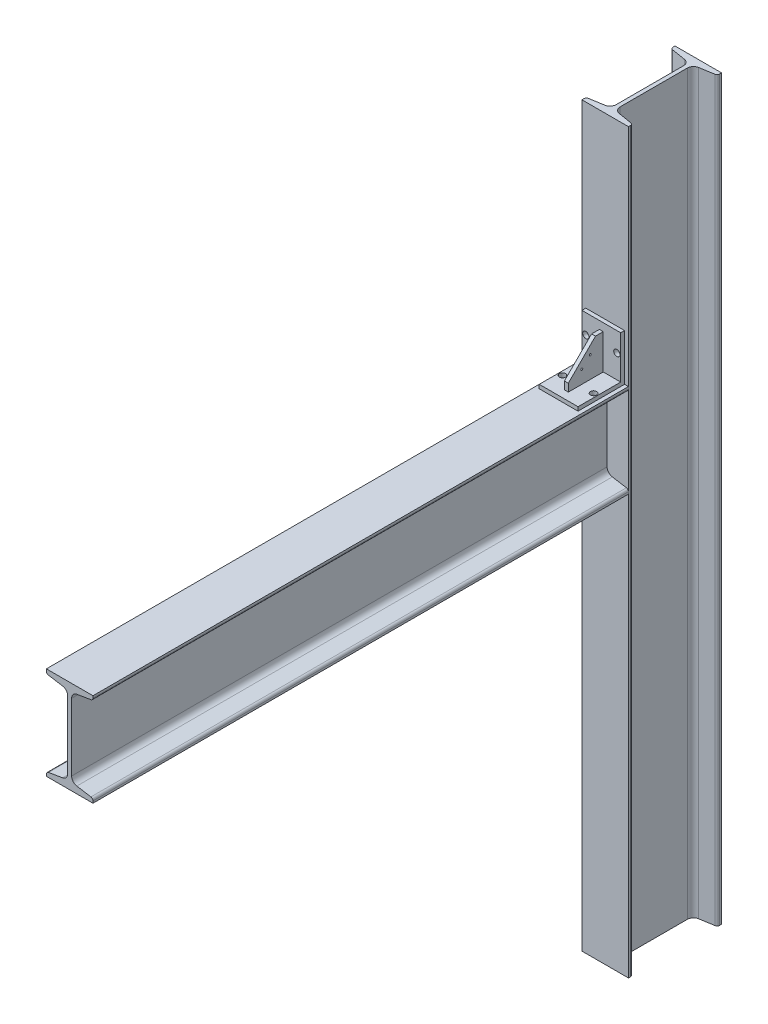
ISO-10303-21;
HEADER;
FILE_DESCRIPTION(('STEP AP214'),'2;1');
FILE_NAME('part.step','',(''),(''),'','','');
FILE_SCHEMA(('AUTOMOTIVE_DESIGN { 1 0 10303 214 1 1 1 1 }'));
ENDSEC;
DATA;
#1=APPLICATION_CONTEXT('core data for automotive mechanical design processes');
#2=APPLICATION_PROTOCOL_DEFINITION('international standard','automotive_design',2000,#1);
#3=PRODUCT_CONTEXT('',#1,'mechanical');
#4=PRODUCT('Part','Part','',(#3));
#5=PRODUCT_RELATED_PRODUCT_CATEGORY('part','',(#4));
#6=PRODUCT_DEFINITION_FORMATION('','',#4);
#7=PRODUCT_DEFINITION_CONTEXT('part definition',#1,'design');
#8=PRODUCT_DEFINITION('design','',#6,#7);
#9=PRODUCT_DEFINITION_SHAPE('','',#8);
#10=(LENGTH_UNIT() NAMED_UNIT(*) SI_UNIT(.MILLI.,.METRE.));
#11=(NAMED_UNIT(*) PLANE_ANGLE_UNIT() SI_UNIT($,.RADIAN.));
#12=(NAMED_UNIT(*) SI_UNIT($,.STERADIAN.) SOLID_ANGLE_UNIT());
#13=UNCERTAINTY_MEASURE_WITH_UNIT(LENGTH_MEASURE(1.E-05),#10,'distance_accuracy_value','');
#14=(GEOMETRIC_REPRESENTATION_CONTEXT(3) GLOBAL_UNCERTAINTY_ASSIGNED_CONTEXT((#13)) GLOBAL_UNIT_ASSIGNED_CONTEXT((#10,
#11,#12)) REPRESENTATION_CONTEXT('',''));
#15=CARTESIAN_POINT('',(0.,0.,0.));
#16=DIRECTION('',(0.,0.,1.));
#17=DIRECTION('',(1.,0.,0.));
#18=AXIS2_PLACEMENT_3D('',#15,#16,#17);
#19=CARTESIAN_POINT('',(-27.3470038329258,590.,-54.2496355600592));
#20=DIRECTION('',(-0.164410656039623,0.,0.986391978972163));
#21=DIRECTION('',(-0.986391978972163,0.,-0.164410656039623));
#22=AXIS2_PLACEMENT_3D('',#19,#20,#21);
#23=PLANE('',#22);
#24=DIRECTION('',(0.986391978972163,0.,0.164410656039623));
#25=VECTOR('',#24,1.);
#26=CARTESIAN_POINT('',(-27.3470038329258,600.,-54.2496355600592));
#27=LINE('',#26,#25);
#28=CARTESIAN_POINT('',(-27.3470038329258,600.,-54.2496355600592));
#29=VERTEX_POINT('',#28);
#30=CARTESIAN_POINT('',(-9.18471475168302,600.,-51.2223665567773));
#31=VERTEX_POINT('',#30);
#32=EDGE_CURVE('E256',#29,#31,#27,.T.);
#33=ORIENTED_EDGE('',*,*,#32,.T.);
#34=DIRECTION('',(0.,1.,0.));
#35=VECTOR('',#34,1.);
#36=CARTESIAN_POINT('',(-9.18471475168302,590.,-51.2223665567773));
#37=LINE('',#36,#35);
#38=CARTESIAN_POINT('',(-9.18471475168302,590.,-51.2223665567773));
#39=VERTEX_POINT('',#38);
#40=EDGE_CURVE('E13',#39,#31,#37,.T.);
#41=ORIENTED_EDGE('',*,*,#40,.F.);
#42=DIRECTION('',(0.986391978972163,0.,0.164410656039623));
#43=VECTOR('',#42,1.);
#44=CARTESIAN_POINT('',(-27.3470038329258,590.,-54.2496355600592));
#45=LINE('',#44,#43);
#46=CARTESIAN_POINT('',(-27.3470038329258,590.,-54.2496355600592));
#47=VERTEX_POINT('',#46);
#48=EDGE_CURVE('E268',#47,#39,#45,.T.);
#49=ORIENTED_EDGE('',*,*,#48,.F.);
#50=DIRECTION('',(0.,1.,0.));
#51=VECTOR('',#50,1.);
#52=CARTESIAN_POINT('',(-27.3470038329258,590.,-54.2496355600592));
#53=LINE('',#52,#51);
#54=EDGE_CURVE('E251',#47,#29,#53,.T.);
#55=ORIENTED_EDGE('',*,*,#54,.T.);
#56=EDGE_LOOP('',(#33,#41,#49,#55));
#57=FACE_BOUND('',#56,.T.);
#58=ADVANCED_FACE('F173',(#57),#23,.F.);
#59=CARTESIAN_POINT('',(-10.5,590.,-43.331230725));
#60=DIRECTION('',(0.,1.,0.));
#61=DIRECTION('',(1.,0.,0.));
#62=AXIS2_PLACEMENT_3D('',#59,#60,#61);
#63=CYLINDRICAL_SURFACE('',#62,8.);
#64=CARTESIAN_POINT('',(-10.5,600.,-43.331230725));
#65=DIRECTION('',(0.,-1.,0.));
#66=DIRECTION('',(-1.,0.,0.));
#67=AXIS2_PLACEMENT_3D('',#64,#65,#66);
#68=CIRCLE('',#67,8.);
#69=CARTESIAN_POINT('',(-2.50000000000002,600.,-43.331230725));
#70=VERTEX_POINT('',#69);
#71=EDGE_CURVE('E263',#31,#70,#68,.T.);
#72=ORIENTED_EDGE('',*,*,#71,.T.);
#73=DIRECTION('',(0.,1.,0.));
#74=VECTOR('',#73,1.);
#75=CARTESIAN_POINT('',(-2.50000000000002,590.,-43.331230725));
#76=LINE('',#75,#74);
#77=CARTESIAN_POINT('',(-2.50000000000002,590.,-43.331230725));
#78=VERTEX_POINT('',#77);
#79=EDGE_CURVE('E182',#78,#70,#76,.T.);
#80=ORIENTED_EDGE('',*,*,#79,.F.);
#81=CARTESIAN_POINT('',(-10.5,590.,-43.331230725));
#82=DIRECTION('',(0.,-1.,0.));
#83=DIRECTION('',(-1.,0.,0.));
#84=AXIS2_PLACEMENT_3D('',#81,#82,#83);
#85=CIRCLE('',#84,8.);
#86=EDGE_CURVE('E230',#39,#78,#85,.T.);
#87=ORIENTED_EDGE('',*,*,#86,.F.);
#88=ORIENTED_EDGE('',*,*,#40,.T.);
#89=EDGE_LOOP('',(#72,#80,#87,#88));
#90=FACE_BOUND('',#89,.T.);
#91=ADVANCED_FACE('F295',(#90),#63,.T.);
#92=CARTESIAN_POINT('',(-2.50000000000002,590.,-43.331230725));
#93=DIRECTION('',(-1.,0.,0.));
#94=DIRECTION('',(0.,0.,-1.));
#95=AXIS2_PLACEMENT_3D('',#92,#93,#94);
#96=PLANE('',#95);
#97=DIRECTION('',(0.,0.,1.));
#98=VECTOR('',#97,1.);
#99=CARTESIAN_POINT('',(-2.50000000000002,600.,-43.331230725));
#100=LINE('',#99,#98);
#101=CARTESIAN_POINT('',(-2.50000000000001,600.,43.331230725));
#102=VERTEX_POINT('',#101);
#103=EDGE_CURVE('E261',#70,#102,#100,.T.);
#104=ORIENTED_EDGE('',*,*,#103,.T.);
#105=DIRECTION('',(0.,1.,0.));
#106=VECTOR('',#105,1.);
#107=CARTESIAN_POINT('',(-2.50000000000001,590.,43.331230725));
#108=LINE('',#107,#106);
#109=CARTESIAN_POINT('',(-2.50000000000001,590.,43.331230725));
#110=VERTEX_POINT('',#109);
#111=EDGE_CURVE('E248',#110,#102,#108,.T.);
#112=ORIENTED_EDGE('',*,*,#111,.F.);
#113=DIRECTION('',(0.,0.,1.));
#114=VECTOR('',#113,1.);
#115=CARTESIAN_POINT('',(-2.50000000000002,590.,-43.331230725));
#116=LINE('',#115,#114);
#117=EDGE_CURVE('E239',#78,#110,#116,.T.);
#118=ORIENTED_EDGE('',*,*,#117,.F.);
#119=ORIENTED_EDGE('',*,*,#79,.T.);
#120=EDGE_LOOP('',(#104,#112,#118,#119));
#121=FACE_BOUND('',#120,.T.);
#122=ADVANCED_FACE('F272',(#121),#96,.F.);
#123=CARTESIAN_POINT('',(-10.5,590.,43.331230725));
#124=DIRECTION('',(0.,1.,0.));
#125=DIRECTION('',(1.,0.,0.));
#126=AXIS2_PLACEMENT_3D('',#123,#124,#125);
#127=CYLINDRICAL_SURFACE('',#126,8.);
#128=CARTESIAN_POINT('',(-10.5,600.,43.331230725));
#129=DIRECTION('',(0.,-1.,0.));
#130=DIRECTION('',(-1.,0.,0.));
#131=AXIS2_PLACEMENT_3D('',#128,#129,#130);
#132=CIRCLE('',#131,8.);
#133=CARTESIAN_POINT('',(-9.18471475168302,600.,51.2223665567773));
#134=VERTEX_POINT('',#133);
#135=EDGE_CURVE('E250',#102,#134,#132,.T.);
#136=ORIENTED_EDGE('',*,*,#135,.T.);
#137=DIRECTION('',(0.,1.,0.));
#138=VECTOR('',#137,1.);
#139=CARTESIAN_POINT('',(-9.18471475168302,590.,51.2223665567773));
#140=LINE('',#139,#138);
#141=CARTESIAN_POINT('',(-9.18471475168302,590.,51.2223665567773));
#142=VERTEX_POINT('',#141);
#143=EDGE_CURVE('E244',#142,#134,#140,.T.);
#144=ORIENTED_EDGE('',*,*,#143,.F.);
#145=CARTESIAN_POINT('',(-10.5,590.,43.331230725));
#146=DIRECTION('',(0.,-1.,0.));
#147=DIRECTION('',(-1.,0.,0.));
#148=AXIS2_PLACEMENT_3D('',#145,#146,#147);
#149=CIRCLE('',#148,8.);
#150=EDGE_CURVE('E234',#110,#142,#149,.T.);
#151=ORIENTED_EDGE('',*,*,#150,.F.);
#152=ORIENTED_EDGE('',*,*,#111,.T.);
#153=EDGE_LOOP('',(#136,#144,#151,#152));
#154=FACE_BOUND('',#153,.T.);
#155=ADVANCED_FACE('F249',(#154),#127,.T.);
#156=CARTESIAN_POINT('',(-9.18471475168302,590.,51.2223665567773));
#157=DIRECTION('',(-0.164410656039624,0.,-0.986391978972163));
#158=DIRECTION('',(0.986391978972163,0.,-0.164410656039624));
#159=AXIS2_PLACEMENT_3D('',#156,#157,#158);
#160=PLANE('',#159);
#161=DIRECTION('',(-0.986391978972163,0.,0.164410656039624));
#162=VECTOR('',#161,1.);
#163=CARTESIAN_POINT('',(-9.18471475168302,600.,51.2223665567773));
#164=LINE('',#163,#162);
#165=CARTESIAN_POINT('',(-27.3470038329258,600.,54.2496355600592));
#166=VERTEX_POINT('',#165);
#167=EDGE_CURVE('E212',#134,#166,#164,.T.);
#168=ORIENTED_EDGE('',*,*,#167,.T.);
#169=DIRECTION('',(0.,1.,0.));
#170=VECTOR('',#169,1.);
#171=CARTESIAN_POINT('',(-27.3470038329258,590.,54.2496355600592));
#172=LINE('',#171,#170);
#173=CARTESIAN_POINT('',(-27.3470038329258,590.,54.2496355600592));
#174=VERTEX_POINT('',#173);
#175=EDGE_CURVE('E247',#174,#166,#172,.T.);
#176=ORIENTED_EDGE('',*,*,#175,.F.);
#177=DIRECTION('',(-0.986391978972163,0.,0.164410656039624));
#178=VECTOR('',#177,1.);
#179=CARTESIAN_POINT('',(-9.18471475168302,590.,51.2223665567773));
#180=LINE('',#179,#178);
#181=EDGE_CURVE('E237',#142,#174,#180,.T.);
#182=ORIENTED_EDGE('',*,*,#181,.F.);
#183=ORIENTED_EDGE('',*,*,#143,.T.);
#184=EDGE_LOOP('',(#168,#176,#182,#183));
#185=FACE_BOUND('',#184,.T.);
#186=ADVANCED_FACE('F255',(#185),#160,.F.);
#187=CARTESIAN_POINT('',(-27.3470038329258,590.,-54.2496355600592));
#188=DIRECTION('',(1.,0.,0.));
#189=DIRECTION('',(0.,0.,1.));
#190=AXIS2_PLACEMENT_3D('',#187,#188,#189);
#191=PLANE('',#190);
#192=DIRECTION('',(0.,0.,-1.));
#193=VECTOR('',#192,1.);
#194=CARTESIAN_POINT('',(-27.3470038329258,600.,-54.2496355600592));
#195=LINE('',#194,#193);
#196=EDGE_CURVE('E217',#166,#29,#195,.T.);
#197=ORIENTED_EDGE('',*,*,#196,.T.);
#198=ORIENTED_EDGE('',*,*,#54,.F.);
#199=DIRECTION('',(0.,0.,-1.));
#200=VECTOR('',#199,1.);
#201=CARTESIAN_POINT('',(-27.3470038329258,590.,-54.2496355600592));
#202=LINE('',#201,#200);
#203=EDGE_CURVE('E187',#174,#47,#202,.T.);
#204=ORIENTED_EDGE('',*,*,#203,.F.);
#205=ORIENTED_EDGE('',*,*,#175,.T.);
#206=EDGE_LOOP('',(#197,#198,#204,#205));
#207=FACE_BOUND('',#206,.T.);
#208=ADVANCED_FACE('F282',(#207),#191,.F.);
#209=CARTESIAN_POINT('',(-10.5,590.,-43.331230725));
#210=DIRECTION('',(0.,-1.,0.));
#211=DIRECTION('',(-1.,0.,0.));
#212=AXIS2_PLACEMENT_3D('',#209,#210,#211);
#213=PLANE('',#212);
#214=ORIENTED_EDGE('',*,*,#48,.T.);
#215=ORIENTED_EDGE('',*,*,#86,.T.);
#216=ORIENTED_EDGE('',*,*,#117,.T.);
#217=ORIENTED_EDGE('',*,*,#150,.T.);
#218=ORIENTED_EDGE('',*,*,#181,.T.);
#219=ORIENTED_EDGE('',*,*,#203,.T.);
#220=EDGE_LOOP('',(#214,#215,#216,#217,#218,#219));
#221=FACE_BOUND('',#220,.T.);
#222=ADVANCED_FACE('F236',(#221),#213,.T.);
#223=CARTESIAN_POINT('',(-10.5,600.,-43.331230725));
#224=DIRECTION('',(0.,-1.,0.));
#225=DIRECTION('',(-1.,0.,0.));
#226=AXIS2_PLACEMENT_3D('',#223,#224,#225);
#227=PLANE('',#226);
#228=ORIENTED_EDGE('',*,*,#32,.F.);
#229=ORIENTED_EDGE('',*,*,#196,.F.);
#230=ORIENTED_EDGE('',*,*,#167,.F.);
#231=ORIENTED_EDGE('',*,*,#135,.F.);
#232=ORIENTED_EDGE('',*,*,#103,.F.);
#233=ORIENTED_EDGE('',*,*,#71,.F.);
#234=EDGE_LOOP('',(#228,#229,#230,#231,#232,#233));
#235=FACE_BOUND('',#234,.T.);
#236=ADVANCED_FACE('F280',(#235),#227,.F.);
#237=CLOSED_SHELL('',(#58,#91,#122,#155,#186,#208,#222,#236));
#238=MANIFOLD_SOLID_BREP('B2',#237);
#239=CARTESIAN_POINT('',(2.5,675.,110.));
#240=DIRECTION('',(0.,0.,-1.));
#241=DIRECTION('',(0.,1.,0.));
#242=AXIS2_PLACEMENT_3D('',#239,#240,#241);
#243=PLANE('',#242);
#244=DIRECTION('',(0.,-1.,0.));
#245=VECTOR('',#244,1.);
#246=CARTESIAN_POINT('',(-2.5,675.,110.));
#247=LINE('',#246,#245);
#248=CARTESIAN_POINT('',(-2.5,675.,110.));
#249=VERTEX_POINT('',#248);
#250=CARTESIAN_POINT('',(-2.5,665.,110.));
#251=VERTEX_POINT('',#250);
#252=EDGE_CURVE('E431',#249,#251,#247,.T.);
#253=ORIENTED_EDGE('',*,*,#252,.T.);
#254=DIRECTION('',(-1.,0.,0.));
#255=VECTOR('',#254,1.);
#256=CARTESIAN_POINT('',(2.5,665.,110.));
#257=LINE('',#256,#255);
#258=CARTESIAN_POINT('',(2.5,665.,110.));
#259=VERTEX_POINT('',#258);
#260=EDGE_CURVE('E171',#259,#251,#257,.T.);
#261=ORIENTED_EDGE('',*,*,#260,.F.);
#262=DIRECTION('',(0.,-1.,0.));
#263=VECTOR('',#262,1.);
#264=CARTESIAN_POINT('',(2.5,675.,110.));
#265=LINE('',#264,#263);
#266=CARTESIAN_POINT('',(2.5,675.,110.));
#267=VERTEX_POINT('',#266);
#268=EDGE_CURVE('E443',#267,#259,#265,.T.);
#269=ORIENTED_EDGE('',*,*,#268,.F.);
#270=DIRECTION('',(-1.,0.,0.));
#271=VECTOR('',#270,1.);
#272=CARTESIAN_POINT('',(2.5,675.,110.));
#273=LINE('',#272,#271);
#274=EDGE_CURVE('E429',#267,#249,#273,.T.);
#275=ORIENTED_EDGE('',*,*,#274,.T.);
#276=EDGE_LOOP('',(#253,#261,#269,#275));
#277=FACE_BOUND('',#276,.T.);
#278=ADVANCED_FACE('F358',(#277),#243,.F.);
#279=CARTESIAN_POINT('',(2.5,665.,110.));
#280=DIRECTION('',(0.,1.,0.));
#281=DIRECTION('',(0.,0.,1.));
#282=AXIS2_PLACEMENT_3D('',#279,#280,#281);
#283=PLANE('',#282);
#284=DIRECTION('',(0.,0.,-1.));
#285=VECTOR('',#284,1.);
#286=CARTESIAN_POINT('',(-2.5,665.,110.));
#287=LINE('',#286,#285);
#288=CARTESIAN_POINT('',(-2.5,665.,64.9999999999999));
#289=VERTEX_POINT('',#288);
#290=EDGE_CURVE('E440',#251,#289,#287,.T.);
#291=ORIENTED_EDGE('',*,*,#290,.T.);
#292=DIRECTION('',(-1.,0.,0.));
#293=VECTOR('',#292,1.);
#294=CARTESIAN_POINT('',(2.5,665.,64.9999999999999));
#295=LINE('',#294,#293);
#296=CARTESIAN_POINT('',(2.5,665.,64.9999999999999));
#297=VERTEX_POINT('',#296);
#298=EDGE_CURVE('E368',#297,#289,#295,.T.);
#299=ORIENTED_EDGE('',*,*,#298,.F.);
#300=DIRECTION('',(0.,0.,-1.));
#301=VECTOR('',#300,1.);
#302=CARTESIAN_POINT('',(2.5,665.,110.));
#303=LINE('',#302,#301);
#304=EDGE_CURVE('E409',#259,#297,#303,.T.);
#305=ORIENTED_EDGE('',*,*,#304,.F.);
#306=ORIENTED_EDGE('',*,*,#260,.T.);
#307=EDGE_LOOP('',(#291,#299,#305,#306));
#308=FACE_BOUND('',#307,.T.);
#309=ADVANCED_FACE('F462',(#308),#283,.F.);
#310=CARTESIAN_POINT('',(2.5,665.,64.9999999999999));
#311=DIRECTION('',(0.,0.,1.));
#312=DIRECTION('',(0.,-1.,0.));
#313=AXIS2_PLACEMENT_3D('',#310,#311,#312);
#314=PLANE('',#313);
#315=DIRECTION('',(0.,1.,0.));
#316=VECTOR('',#315,1.);
#317=CARTESIAN_POINT('',(-2.5,665.,64.9999999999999));
#318=LINE('',#317,#316);
#319=CARTESIAN_POINT('',(-2.5,710.,64.9999999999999));
#320=VERTEX_POINT('',#319);
#321=EDGE_CURVE('E424',#289,#320,#318,.T.);
#322=ORIENTED_EDGE('',*,*,#321,.T.);
#323=DIRECTION('',(-1.,0.,0.));
#324=VECTOR('',#323,1.);
#325=CARTESIAN_POINT('',(2.5,710.,64.9999999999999));
#326=LINE('',#325,#324);
#327=CARTESIAN_POINT('',(2.5,710.,64.9999999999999));
#328=VERTEX_POINT('',#327);
#329=EDGE_CURVE('E425',#328,#320,#326,.T.);
#330=ORIENTED_EDGE('',*,*,#329,.F.);
#331=DIRECTION('',(0.,1.,0.));
#332=VECTOR('',#331,1.);
#333=CARTESIAN_POINT('',(2.5,665.,64.9999999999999));
#334=LINE('',#333,#332);
#335=EDGE_CURVE('E414',#297,#328,#334,.T.);
#336=ORIENTED_EDGE('',*,*,#335,.F.);
#337=ORIENTED_EDGE('',*,*,#298,.T.);
#338=EDGE_LOOP('',(#322,#330,#336,#337));
#339=FACE_BOUND('',#338,.T.);
#340=ADVANCED_FACE('F423',(#339),#314,.F.);
#341=CARTESIAN_POINT('',(2.5,710.,64.9999999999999));
#342=DIRECTION('',(0.,-1.,0.));
#343=DIRECTION('',(0.,0.,-1.));
#344=AXIS2_PLACEMENT_3D('',#341,#342,#343);
#345=PLANE('',#344);
#346=DIRECTION('',(0.,0.,1.));
#347=VECTOR('',#346,1.);
#348=CARTESIAN_POINT('',(-2.5,710.,64.9999999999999));
#349=LINE('',#348,#347);
#350=CARTESIAN_POINT('',(-2.5,710.,75.));
#351=VERTEX_POINT('',#350);
#352=EDGE_CURVE('E399',#320,#351,#349,.T.);
#353=ORIENTED_EDGE('',*,*,#352,.T.);
#354=DIRECTION('',(-1.,0.,0.));
#355=VECTOR('',#354,1.);
#356=CARTESIAN_POINT('',(2.5,710.,75.));
#357=LINE('',#356,#355);
#358=CARTESIAN_POINT('',(2.5,710.,75.));
#359=VERTEX_POINT('',#358);
#360=EDGE_CURVE('E426',#359,#351,#357,.T.);
#361=ORIENTED_EDGE('',*,*,#360,.F.);
#362=DIRECTION('',(0.,0.,1.));
#363=VECTOR('',#362,1.);
#364=CARTESIAN_POINT('',(2.5,710.,64.9999999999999));
#365=LINE('',#364,#363);
#366=EDGE_CURVE('E418',#328,#359,#365,.T.);
#367=ORIENTED_EDGE('',*,*,#366,.F.);
#368=ORIENTED_EDGE('',*,*,#329,.T.);
#369=EDGE_LOOP('',(#353,#361,#367,#368));
#370=FACE_BOUND('',#369,.T.);
#371=ADVANCED_FACE('F427',(#370),#345,.F.);
#372=CARTESIAN_POINT('',(2.5,710.,75.));
#373=DIRECTION('',(0.,-0.707106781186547,-0.707106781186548));
#374=DIRECTION('',(0.,0.707106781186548,-0.707106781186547));
#375=AXIS2_PLACEMENT_3D('',#372,#373,#374);
#376=PLANE('',#375);
#377=DIRECTION('',(0.,-0.707106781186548,0.707106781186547));
#378=VECTOR('',#377,1.);
#379=CARTESIAN_POINT('',(-2.5,710.,75.));
#380=LINE('',#379,#378);
#381=EDGE_CURVE('E405',#351,#249,#380,.T.);
#382=ORIENTED_EDGE('',*,*,#381,.T.);
#383=ORIENTED_EDGE('',*,*,#274,.F.);
#384=DIRECTION('',(0.,-0.707106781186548,0.707106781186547));
#385=VECTOR('',#384,1.);
#386=CARTESIAN_POINT('',(2.5,710.,75.));
#387=LINE('',#386,#385);
#388=EDGE_CURVE('E377',#359,#267,#387,.T.);
#389=ORIENTED_EDGE('',*,*,#388,.F.);
#390=ORIENTED_EDGE('',*,*,#360,.T.);
#391=EDGE_LOOP('',(#382,#383,#389,#390));
#392=FACE_BOUND('',#391,.T.);
#393=ADVANCED_FACE('F452',(#392),#376,.F.);
#394=CARTESIAN_POINT('',(2.5,665.,64.9999999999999));
#395=DIRECTION('',(1.,0.,0.));
#396=DIRECTION('',(0.,1.,0.));
#397=AXIS2_PLACEMENT_3D('',#394,#395,#396);
#398=PLANE('',#397);
#399=CARTESIAN_POINT('',(2.5,681.775737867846,92.6176604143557));
#400=DIRECTION('',(1.,0.,0.));
#401=DIRECTION('',(0.,1.,0.));
#402=AXIS2_PLACEMENT_3D('',#399,#400,#401);
#403=CIRCLE('',#402,1.24999999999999);
#404=CARTESIAN_POINT('',(2.5,683.025737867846,92.6176604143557));
#405=VERTEX_POINT('',#404);
#406=EDGE_CURVE('E546',#405,#405,#403,.T.);
#407=ORIENTED_EDGE('',*,*,#406,.F.);
#408=EDGE_LOOP('',(#407));
#409=FACE_BOUND('',#408,.T.);
#410=CARTESIAN_POINT('',(2.5,692.617660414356,81.775737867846));
#411=DIRECTION('',(1.,0.,0.));
#412=DIRECTION('',(0.,1.,0.));
#413=AXIS2_PLACEMENT_3D('',#410,#411,#412);
#414=CIRCLE('',#413,1.24999999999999);
#415=CARTESIAN_POINT('',(2.5,693.867660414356,81.775737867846));
#416=VERTEX_POINT('',#415);
#417=EDGE_CURVE('E557',#416,#416,#414,.T.);
#418=ORIENTED_EDGE('',*,*,#417,.F.);
#419=EDGE_LOOP('',(#418));
#420=FACE_BOUND('',#419,.T.);
#421=ORIENTED_EDGE('',*,*,#268,.T.);
#422=ORIENTED_EDGE('',*,*,#304,.T.);
#423=ORIENTED_EDGE('',*,*,#335,.T.);
#424=ORIENTED_EDGE('',*,*,#366,.T.);
#425=ORIENTED_EDGE('',*,*,#388,.T.);
#426=EDGE_LOOP('',(#421,#422,#423,#424,#425));
#427=FACE_BOUND('',#426,.T.);
#428=ADVANCED_FACE('F416',(#409,#420,#427),#398,.T.);
#429=CARTESIAN_POINT('',(-2.5,665.,64.9999999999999));
#430=DIRECTION('',(1.,0.,0.));
#431=DIRECTION('',(0.,1.,0.));
#432=AXIS2_PLACEMENT_3D('',#429,#430,#431);
#433=PLANE('',#432);
#434=CARTESIAN_POINT('',(-2.5,681.775737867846,92.6176604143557));
#435=DIRECTION('',(1.,0.,0.));
#436=DIRECTION('',(0.,1.,0.));
#437=AXIS2_PLACEMENT_3D('',#434,#435,#436);
#438=CIRCLE('',#437,1.275);
#439=CARTESIAN_POINT('',(-2.5,683.050737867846,92.6176604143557));
#440=VERTEX_POINT('',#439);
#441=EDGE_CURVE('E550',#440,#440,#438,.T.);
#442=ORIENTED_EDGE('',*,*,#441,.T.);
#443=EDGE_LOOP('',(#442));
#444=FACE_BOUND('',#443,.T.);
#445=CARTESIAN_POINT('',(-2.5,692.617660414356,81.775737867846));
#446=DIRECTION('',(1.,0.,0.));
#447=DIRECTION('',(0.,1.,0.));
#448=AXIS2_PLACEMENT_3D('',#445,#446,#447);
#449=CIRCLE('',#448,1.275);
#450=CARTESIAN_POINT('',(-2.5,693.892660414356,81.775737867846));
#451=VERTEX_POINT('',#450);
#452=EDGE_CURVE('E547',#451,#451,#449,.T.);
#453=ORIENTED_EDGE('',*,*,#452,.T.);
#454=EDGE_LOOP('',(#453));
#455=FACE_BOUND('',#454,.T.);
#456=ORIENTED_EDGE('',*,*,#252,.F.);
#457=ORIENTED_EDGE('',*,*,#381,.F.);
#458=ORIENTED_EDGE('',*,*,#352,.F.);
#459=ORIENTED_EDGE('',*,*,#321,.F.);
#460=ORIENTED_EDGE('',*,*,#290,.F.);
#461=EDGE_LOOP('',(#456,#457,#458,#459,#460));
#462=FACE_BOUND('',#461,.T.);
#463=ADVANCED_FACE('F446',(#444,#455,#462),#433,.F.);
#464=CARTESIAN_POINT('',(-2.475,692.617660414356,81.775737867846));
#465=DIRECTION('',(-1.,0.,0.));
#466=DIRECTION('',(0.,-1.,0.));
#467=AXIS2_PLACEMENT_3D('',#464,#465,#466);
#468=CONICAL_SURFACE('',#467,1.25,0.785398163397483);
#469=ORIENTED_EDGE('',*,*,#452,.F.);
#470=EDGE_LOOP('',(#469));
#471=FACE_BOUND('',#470,.T.);
#472=CARTESIAN_POINT('',(-2.475,692.617660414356,81.775737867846));
#473=DIRECTION('',(1.,0.,0.));
#474=DIRECTION('',(0.,1.,0.));
#475=AXIS2_PLACEMENT_3D('',#472,#473,#474);
#476=CIRCLE('',#475,1.25);
#477=CARTESIAN_POINT('',(-2.475,693.867660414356,81.775737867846));
#478=VERTEX_POINT('',#477);
#479=EDGE_CURVE('E437',#478,#478,#476,.T.);
#480=ORIENTED_EDGE('',*,*,#479,.T.);
#481=EDGE_LOOP('',(#480));
#482=FACE_BOUND('',#481,.T.);
#483=ADVANCED_FACE('F497',(#471,#482),#468,.F.);
#484=CARTESIAN_POINT('',(2.5,692.617660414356,81.775737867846));
#485=DIRECTION('',(1.,0.,0.));
#486=DIRECTION('',(0.,1.,0.));
#487=AXIS2_PLACEMENT_3D('',#484,#485,#486);
#488=CYLINDRICAL_SURFACE('',#487,1.24999999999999);
#489=ORIENTED_EDGE('',*,*,#479,.F.);
#490=EDGE_LOOP('',(#489));
#491=FACE_BOUND('',#490,.T.);
#492=ORIENTED_EDGE('',*,*,#417,.T.);
#493=EDGE_LOOP('',(#492));
#494=FACE_BOUND('',#493,.T.);
#495=ADVANCED_FACE('F509',(#491,#494),#488,.F.);
#496=CARTESIAN_POINT('',(-2.475,681.775737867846,92.6176604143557));
#497=DIRECTION('',(-1.,0.,0.));
#498=DIRECTION('',(0.,-1.,0.));
#499=AXIS2_PLACEMENT_3D('',#496,#497,#498);
#500=CONICAL_SURFACE('',#499,1.25,0.785398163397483);
#501=ORIENTED_EDGE('',*,*,#441,.F.);
#502=EDGE_LOOP('',(#501));
#503=FACE_BOUND('',#502,.T.);
#504=CARTESIAN_POINT('',(-2.475,681.775737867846,92.6176604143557));
#505=DIRECTION('',(1.,0.,0.));
#506=DIRECTION('',(0.,1.,0.));
#507=AXIS2_PLACEMENT_3D('',#504,#505,#506);
#508=CIRCLE('',#507,1.25);
#509=CARTESIAN_POINT('',(-2.475,683.025737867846,92.6176604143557));
#510=VERTEX_POINT('',#509);
#511=EDGE_CURVE('E542',#510,#510,#508,.T.);
#512=ORIENTED_EDGE('',*,*,#511,.T.);
#513=EDGE_LOOP('',(#512));
#514=FACE_BOUND('',#513,.T.);
#515=ADVANCED_FACE('F518',(#503,#514),#500,.F.);
#516=CARTESIAN_POINT('',(2.5,681.775737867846,92.6176604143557));
#517=DIRECTION('',(1.,0.,0.));
#518=DIRECTION('',(0.,1.,0.));
#519=AXIS2_PLACEMENT_3D('',#516,#517,#518);
#520=CYLINDRICAL_SURFACE('',#519,1.24999999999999);
#521=ORIENTED_EDGE('',*,*,#511,.F.);
#522=EDGE_LOOP('',(#521));
#523=FACE_BOUND('',#522,.T.);
#524=ORIENTED_EDGE('',*,*,#406,.T.);
#525=EDGE_LOOP('',(#524));
#526=FACE_BOUND('',#525,.T.);
#527=ADVANCED_FACE('F529',(#523,#526),#520,.F.);
#528=CLOSED_SHELL('',(#278,#309,#340,#371,#393,#428,#463,#483,#495,#515,#527));
#529=MANIFOLD_SOLID_BREP('B7',#528);
#530=CARTESIAN_POINT('',(-25.,660.,60.));
#531=DIRECTION('',(0.,1.,0.));
#532=DIRECTION('',(-1.,0.,0.));
#533=AXIS2_PLACEMENT_3D('',#530,#531,#532);
#534=PLANE('',#533);
#535=CARTESIAN_POINT('',(20.,660.,95.));
#536=DIRECTION('',(0.,1.,0.));
#537=DIRECTION('',(-1.,0.,0.));
#538=AXIS2_PLACEMENT_3D('',#535,#536,#537);
#539=CIRCLE('',#538,4.);
#540=CARTESIAN_POINT('',(16.,660.,95.));
#541=VERTEX_POINT('',#540);
#542=EDGE_CURVE('E685',#541,#541,#539,.T.);
#543=ORIENTED_EDGE('',*,*,#542,.T.);
#544=EDGE_LOOP('',(#543));
#545=FACE_BOUND('',#544,.T.);
#546=CARTESIAN_POINT('',(-20.,660.,95.));
#547=DIRECTION('',(0.,1.,0.));
#548=DIRECTION('',(-1.,0.,0.));
#549=AXIS2_PLACEMENT_3D('',#546,#547,#548);
#550=CIRCLE('',#549,4.);
#551=CARTESIAN_POINT('',(-24.,660.,95.));
#552=VERTEX_POINT('',#551);
#553=EDGE_CURVE('E715',#552,#552,#550,.T.);
#554=ORIENTED_EDGE('',*,*,#553,.T.);
#555=EDGE_LOOP('',(#554));
#556=FACE_BOUND('',#555,.T.);
#557=DIRECTION('',(0.,0.,1.));
#558=VECTOR('',#557,1.);
#559=CARTESIAN_POINT('',(25.,660.,60.));
#560=LINE('',#559,#558);
#561=CARTESIAN_POINT('',(25.,660.,60.));
#562=VERTEX_POINT('',#561);
#563=CARTESIAN_POINT('',(25.,660.,120.));
#564=VERTEX_POINT('',#563);
#565=EDGE_CURVE('E679',#562,#564,#560,.T.);
#566=ORIENTED_EDGE('',*,*,#565,.T.);
#567=DIRECTION('',(1.,0.,0.));
#568=VECTOR('',#567,1.);
#569=CARTESIAN_POINT('',(-25.,660.,120.));
#570=LINE('',#569,#568);
#571=CARTESIAN_POINT('',(-25.,660.,120.));
#572=VERTEX_POINT('',#571);
#573=EDGE_CURVE('E359',#572,#564,#570,.T.);
#574=ORIENTED_EDGE('',*,*,#573,.F.);
#575=DIRECTION('',(0.,0.,1.));
#576=VECTOR('',#575,1.);
#577=CARTESIAN_POINT('',(-25.,660.,60.));
#578=LINE('',#577,#576);
#579=CARTESIAN_POINT('',(-25.,660.,60.));
#580=VERTEX_POINT('',#579);
#581=EDGE_CURVE('E688',#580,#572,#578,.T.);
#582=ORIENTED_EDGE('',*,*,#581,.F.);
#583=DIRECTION('',(1.,0.,0.));
#584=VECTOR('',#583,1.);
#585=CARTESIAN_POINT('',(-25.,660.,60.));
#586=LINE('',#585,#584);
#587=EDGE_CURVE('E673',#580,#562,#586,.T.);
#588=ORIENTED_EDGE('',*,*,#587,.T.);
#589=EDGE_LOOP('',(#566,#574,#582,#588));
#590=FACE_BOUND('',#589,.T.);
#591=ADVANCED_FACE('F595',(#545,#556,#590),#534,.F.);
#592=CARTESIAN_POINT('',(-25.,665.,120.));
#593=DIRECTION('',(0.,0.,-1.));
#594=DIRECTION('',(-1.,0.,0.));
#595=AXIS2_PLACEMENT_3D('',#592,#593,#594);
#596=PLANE('',#595);
#597=DIRECTION('',(0.,1.,0.));
#598=VECTOR('',#597,1.);
#599=CARTESIAN_POINT('',(25.,665.,120.));
#600=LINE('',#599,#598);
#601=CARTESIAN_POINT('',(25.,665.,120.));
#602=VERTEX_POINT('',#601);
#603=EDGE_CURVE('E682',#564,#602,#600,.T.);
#604=ORIENTED_EDGE('',*,*,#603,.T.);
#605=DIRECTION('',(1.,0.,0.));
#606=VECTOR('',#605,1.);
#607=CARTESIAN_POINT('',(-25.,665.,120.));
#608=LINE('',#607,#606);
#609=CARTESIAN_POINT('',(-25.,665.,120.));
#610=VERTEX_POINT('',#609);
#611=EDGE_CURVE('E602',#610,#602,#608,.T.);
#612=ORIENTED_EDGE('',*,*,#611,.F.);
#613=DIRECTION('',(0.,1.,0.));
#614=VECTOR('',#613,1.);
#615=CARTESIAN_POINT('',(-25.,665.,120.));
#616=LINE('',#615,#614);
#617=EDGE_CURVE('E650',#572,#610,#616,.T.);
#618=ORIENTED_EDGE('',*,*,#617,.F.);
#619=ORIENTED_EDGE('',*,*,#573,.T.);
#620=EDGE_LOOP('',(#604,#612,#618,#619));
#621=FACE_BOUND('',#620,.T.);
#622=ADVANCED_FACE('F725',(#621),#596,.F.);
#623=CARTESIAN_POINT('',(-25.,665.,65.));
#624=DIRECTION('',(0.,-1.,0.));
#625=DIRECTION('',(1.,0.,0.));
#626=AXIS2_PLACEMENT_3D('',#623,#624,#625);
#627=PLANE('',#626);
#628=CARTESIAN_POINT('',(20.,665.,95.));
#629=DIRECTION('',(0.,1.,0.));
#630=DIRECTION('',(-1.,0.,0.));
#631=AXIS2_PLACEMENT_3D('',#628,#629,#630);
#632=CIRCLE('',#631,4.);
#633=CARTESIAN_POINT('',(16.,665.,95.));
#634=VERTEX_POINT('',#633);
#635=EDGE_CURVE('E710',#634,#634,#632,.T.);
#636=ORIENTED_EDGE('',*,*,#635,.F.);
#637=EDGE_LOOP('',(#636));
#638=FACE_BOUND('',#637,.T.);
#639=CARTESIAN_POINT('',(-20.,665.,95.));
#640=DIRECTION('',(0.,1.,0.));
#641=DIRECTION('',(-1.,0.,0.));
#642=AXIS2_PLACEMENT_3D('',#639,#640,#641);
#643=CIRCLE('',#642,4.);
#644=CARTESIAN_POINT('',(-24.,665.,95.));
#645=VERTEX_POINT('',#644);
#646=EDGE_CURVE('E697',#645,#645,#643,.T.);
#647=ORIENTED_EDGE('',*,*,#646,.F.);
#648=EDGE_LOOP('',(#647));
#649=FACE_BOUND('',#648,.T.);
#650=DIRECTION('',(0.,0.,-1.));
#651=VECTOR('',#650,1.);
#652=CARTESIAN_POINT('',(25.,665.,65.));
#653=LINE('',#652,#651);
#654=CARTESIAN_POINT('',(25.,665.,65.));
#655=VERTEX_POINT('',#654);
#656=EDGE_CURVE('E684',#602,#655,#653,.T.);
#657=ORIENTED_EDGE('',*,*,#656,.T.);
#658=DIRECTION('',(1.,0.,0.));
#659=VECTOR('',#658,1.);
#660=CARTESIAN_POINT('',(-25.,665.,65.));
#661=LINE('',#660,#659);
#662=CARTESIAN_POINT('',(-25.,665.,65.));
#663=VERTEX_POINT('',#662);
#664=EDGE_CURVE('E667',#663,#655,#661,.T.);
#665=ORIENTED_EDGE('',*,*,#664,.F.);
#666=DIRECTION('',(0.,0.,-1.));
#667=VECTOR('',#666,1.);
#668=CARTESIAN_POINT('',(-25.,665.,65.));
#669=LINE('',#668,#667);
#670=EDGE_CURVE('E658',#610,#663,#669,.T.);
#671=ORIENTED_EDGE('',*,*,#670,.F.);
#672=ORIENTED_EDGE('',*,*,#611,.T.);
#673=EDGE_LOOP('',(#657,#665,#671,#672));
#674=FACE_BOUND('',#673,.T.);
#675=ADVANCED_FACE('F724',(#638,#649,#674),#627,.F.);
#676=CARTESIAN_POINT('',(-25.,720.,65.));
#677=DIRECTION('',(0.,0.,-1.));
#678=DIRECTION('',(0.,-1.,0.));
#679=AXIS2_PLACEMENT_3D('',#676,#677,#678);
#680=PLANE('',#679);
#681=CARTESIAN_POINT('',(-20.,695.,65.));
#682=DIRECTION('',(0.,0.,1.));
#683=DIRECTION('',(0.,1.,0.));
#684=AXIS2_PLACEMENT_3D('',#681,#682,#683);
#685=CIRCLE('',#684,4.);
#686=CARTESIAN_POINT('',(-20.,699.,65.));
#687=VERTEX_POINT('',#686);
#688=EDGE_CURVE('E699',#687,#687,#685,.T.);
#689=ORIENTED_EDGE('',*,*,#688,.F.);
#690=EDGE_LOOP('',(#689));
#691=FACE_BOUND('',#690,.T.);
#692=CARTESIAN_POINT('',(20.,695.,65.));
#693=DIRECTION('',(0.,0.,1.));
#694=DIRECTION('',(0.,1.,0.));
#695=AXIS2_PLACEMENT_3D('',#692,#693,#694);
#696=CIRCLE('',#695,4.);
#697=CARTESIAN_POINT('',(20.,699.,65.));
#698=VERTEX_POINT('',#697);
#699=EDGE_CURVE('E705',#698,#698,#696,.T.);
#700=ORIENTED_EDGE('',*,*,#699,.F.);
#701=EDGE_LOOP('',(#700));
#702=FACE_BOUND('',#701,.T.);
#703=DIRECTION('',(0.,1.,0.));
#704=VECTOR('',#703,1.);
#705=CARTESIAN_POINT('',(25.,720.,65.));
#706=LINE('',#705,#704);
#707=CARTESIAN_POINT('',(25.,720.,65.));
#708=VERTEX_POINT('',#707);
#709=EDGE_CURVE('E668',#655,#708,#706,.T.);
#710=ORIENTED_EDGE('',*,*,#709,.T.);
#711=DIRECTION('',(1.,0.,0.));
#712=VECTOR('',#711,1.);
#713=CARTESIAN_POINT('',(-25.,720.,65.));
#714=LINE('',#713,#712);
#715=CARTESIAN_POINT('',(-25.,720.,65.));
#716=VERTEX_POINT('',#715);
#717=EDGE_CURVE('E664',#716,#708,#714,.T.);
#718=ORIENTED_EDGE('',*,*,#717,.F.);
#719=DIRECTION('',(0.,1.,0.));
#720=VECTOR('',#719,1.);
#721=CARTESIAN_POINT('',(-25.,720.,65.));
#722=LINE('',#721,#720);
#723=EDGE_CURVE('E653',#663,#716,#722,.T.);
#724=ORIENTED_EDGE('',*,*,#723,.F.);
#725=ORIENTED_EDGE('',*,*,#664,.T.);
#726=EDGE_LOOP('',(#710,#718,#724,#725));
#727=FACE_BOUND('',#726,.T.);
#728=ADVANCED_FACE('F666',(#691,#702,#727),#680,.F.);
#729=CARTESIAN_POINT('',(-25.,720.,60.));
#730=DIRECTION('',(0.,-1.,0.));
#731=DIRECTION('',(1.,0.,0.));
#732=AXIS2_PLACEMENT_3D('',#729,#730,#731);
#733=PLANE('',#732);
#734=DIRECTION('',(0.,0.,-1.));
#735=VECTOR('',#734,1.);
#736=CARTESIAN_POINT('',(25.,720.,60.));
#737=LINE('',#736,#735);
#738=CARTESIAN_POINT('',(25.,720.,60.));
#739=VERTEX_POINT('',#738);
#740=EDGE_CURVE('E631',#708,#739,#737,.T.);
#741=ORIENTED_EDGE('',*,*,#740,.T.);
#742=DIRECTION('',(1.,0.,0.));
#743=VECTOR('',#742,1.);
#744=CARTESIAN_POINT('',(-25.,720.,60.));
#745=LINE('',#744,#743);
#746=CARTESIAN_POINT('',(-25.,720.,60.));
#747=VERTEX_POINT('',#746);
#748=EDGE_CURVE('E669',#747,#739,#745,.T.);
#749=ORIENTED_EDGE('',*,*,#748,.F.);
#750=DIRECTION('',(0.,0.,-1.));
#751=VECTOR('',#750,1.);
#752=CARTESIAN_POINT('',(-25.,720.,60.));
#753=LINE('',#752,#751);
#754=EDGE_CURVE('E659',#716,#747,#753,.T.);
#755=ORIENTED_EDGE('',*,*,#754,.F.);
#756=ORIENTED_EDGE('',*,*,#717,.T.);
#757=EDGE_LOOP('',(#741,#749,#755,#756));
#758=FACE_BOUND('',#757,.T.);
#759=ADVANCED_FACE('F671',(#758),#733,.F.);
#760=CARTESIAN_POINT('',(-25.,660.,60.));
#761=DIRECTION('',(0.,0.,1.));
#762=DIRECTION('',(1.,0.,0.));
#763=AXIS2_PLACEMENT_3D('',#760,#761,#762);
#764=PLANE('',#763);
#765=CARTESIAN_POINT('',(-20.,695.,60.));
#766=DIRECTION('',(0.,0.,1.));
#767=DIRECTION('',(1.,0.,0.));
#768=AXIS2_PLACEMENT_3D('',#765,#766,#767);
#769=CIRCLE('',#768,4.);
#770=CARTESIAN_POINT('',(-16.,695.,60.));
#771=VERTEX_POINT('',#770);
#772=EDGE_CURVE('E594',#771,#771,#769,.T.);
#773=ORIENTED_EDGE('',*,*,#772,.T.);
#774=EDGE_LOOP('',(#773));
#775=FACE_BOUND('',#774,.T.);
#776=CARTESIAN_POINT('',(20.,695.,60.));
#777=DIRECTION('',(0.,0.,1.));
#778=DIRECTION('',(1.,0.,0.));
#779=AXIS2_PLACEMENT_3D('',#776,#777,#778);
#780=CIRCLE('',#779,4.);
#781=CARTESIAN_POINT('',(24.,695.,60.));
#782=VERTEX_POINT('',#781);
#783=EDGE_CURVE('E692',#782,#782,#780,.T.);
#784=ORIENTED_EDGE('',*,*,#783,.T.);
#785=EDGE_LOOP('',(#784));
#786=FACE_BOUND('',#785,.T.);
#787=DIRECTION('',(0.,-1.,0.));
#788=VECTOR('',#787,1.);
#789=CARTESIAN_POINT('',(25.,660.,60.));
#790=LINE('',#789,#788);
#791=EDGE_CURVE('E639',#739,#562,#790,.T.);
#792=ORIENTED_EDGE('',*,*,#791,.T.);
#793=ORIENTED_EDGE('',*,*,#587,.F.);
#794=DIRECTION('',(0.,-1.,0.));
#795=VECTOR('',#794,1.);
#796=CARTESIAN_POINT('',(-25.,660.,60.));
#797=LINE('',#796,#795);
#798=EDGE_CURVE('E608',#747,#580,#797,.T.);
#799=ORIENTED_EDGE('',*,*,#798,.F.);
#800=ORIENTED_EDGE('',*,*,#748,.T.);
#801=EDGE_LOOP('',(#792,#793,#799,#800));
#802=FACE_BOUND('',#801,.T.);
#803=ADVANCED_FACE('F729',(#775,#786,#802),#764,.F.);
#804=CARTESIAN_POINT('',(-25.,660.,60.));
#805=DIRECTION('',(1.,0.,0.));
#806=DIRECTION('',(0.,0.,-1.));
#807=AXIS2_PLACEMENT_3D('',#804,#805,#806);
#808=PLANE('',#807);
#809=ORIENTED_EDGE('',*,*,#581,.T.);
#810=ORIENTED_EDGE('',*,*,#617,.T.);
#811=ORIENTED_EDGE('',*,*,#670,.T.);
#812=ORIENTED_EDGE('',*,*,#723,.T.);
#813=ORIENTED_EDGE('',*,*,#754,.T.);
#814=ORIENTED_EDGE('',*,*,#798,.T.);
#815=EDGE_LOOP('',(#809,#810,#811,#812,#813,#814));
#816=FACE_BOUND('',#815,.T.);
#817=ADVANCED_FACE('F657',(#816),#808,.F.);
#818=CARTESIAN_POINT('',(25.,660.,60.));
#819=DIRECTION('',(1.,0.,0.));
#820=DIRECTION('',(0.,0.,-1.));
#821=AXIS2_PLACEMENT_3D('',#818,#819,#820);
#822=PLANE('',#821);
#823=ORIENTED_EDGE('',*,*,#565,.F.);
#824=ORIENTED_EDGE('',*,*,#791,.F.);
#825=ORIENTED_EDGE('',*,*,#740,.F.);
#826=ORIENTED_EDGE('',*,*,#709,.F.);
#827=ORIENTED_EDGE('',*,*,#656,.F.);
#828=ORIENTED_EDGE('',*,*,#603,.F.);
#829=EDGE_LOOP('',(#823,#824,#825,#826,#827,#828));
#830=FACE_BOUND('',#829,.T.);
#831=ADVANCED_FACE('F727',(#830),#822,.T.);
#832=CARTESIAN_POINT('',(-20.,615.,95.));
#833=DIRECTION('',(0.,1.,0.));
#834=DIRECTION('',(-1.,0.,0.));
#835=AXIS2_PLACEMENT_3D('',#832,#833,#834);
#836=CYLINDRICAL_SURFACE('',#835,4.);
#837=ORIENTED_EDGE('',*,*,#646,.T.);
#838=EDGE_LOOP('',(#837));
#839=FACE_BOUND('',#838,.T.);
#840=ORIENTED_EDGE('',*,*,#553,.F.);
#841=EDGE_LOOP('',(#840));
#842=FACE_BOUND('',#841,.T.);
#843=ADVANCED_FACE('F747',(#839,#842),#836,.F.);
#844=CARTESIAN_POINT('',(20.,615.,95.));
#845=DIRECTION('',(0.,1.,0.));
#846=DIRECTION('',(-1.,0.,0.));
#847=AXIS2_PLACEMENT_3D('',#844,#845,#846);
#848=CYLINDRICAL_SURFACE('',#847,4.);
#849=ORIENTED_EDGE('',*,*,#635,.T.);
#850=EDGE_LOOP('',(#849));
#851=FACE_BOUND('',#850,.T.);
#852=ORIENTED_EDGE('',*,*,#542,.F.);
#853=EDGE_LOOP('',(#852));
#854=FACE_BOUND('',#853,.T.);
#855=ADVANCED_FACE('F755',(#851,#854),#848,.F.);
#856=CARTESIAN_POINT('',(20.,695.,15.));
#857=DIRECTION('',(0.,0.,1.));
#858=DIRECTION('',(0.,1.,0.));
#859=AXIS2_PLACEMENT_3D('',#856,#857,#858);
#860=CYLINDRICAL_SURFACE('',#859,4.);
#861=ORIENTED_EDGE('',*,*,#699,.T.);
#862=EDGE_LOOP('',(#861));
#863=FACE_BOUND('',#862,.T.);
#864=ORIENTED_EDGE('',*,*,#783,.F.);
#865=EDGE_LOOP('',(#864));
#866=FACE_BOUND('',#865,.T.);
#867=ADVANCED_FACE('F759',(#863,#866),#860,.F.);
#868=CARTESIAN_POINT('',(-20.,695.,15.));
#869=DIRECTION('',(0.,0.,1.));
#870=DIRECTION('',(0.,1.,0.));
#871=AXIS2_PLACEMENT_3D('',#868,#869,#870);
#872=CYLINDRICAL_SURFACE('',#871,4.);
#873=ORIENTED_EDGE('',*,*,#688,.T.);
#874=EDGE_LOOP('',(#873));
#875=FACE_BOUND('',#874,.T.);
#876=ORIENTED_EDGE('',*,*,#772,.F.);
#877=EDGE_LOOP('',(#876));
#878=FACE_BOUND('',#877,.T.);
#879=ADVANCED_FACE('F764',(#875,#878),#872,.F.);
#880=CLOSED_SHELL('',(#591,#622,#675,#728,#759,#803,#817,#831,#843,#855,#867,#879));
#881=MANIFOLD_SOLID_BREP('B166',#880);
#882=CARTESIAN_POINT('',(-26.825,542.618569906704,750.));
#883=DIRECTION('',(0.,0.,-1.));
#884=DIRECTION('',(0.,1.,0.));
#885=AXIS2_PLACEMENT_3D('',#882,#883,#884);
#886=PLANE('',#885);
#887=DIRECTION('',(1.,0.,0.));
#888=VECTOR('',#887,1.);
#889=CARTESIAN_POINT('',(30.,540.,750.));
#890=LINE('',#889,#888);
#891=CARTESIAN_POINT('',(-30.,540.,750.));
#892=VERTEX_POINT('',#891);
#893=CARTESIAN_POINT('',(30.,540.,750.));
#894=VERTEX_POINT('',#893);
#895=EDGE_CURVE('E1012',#892,#894,#890,.T.);
#896=ORIENTED_EDGE('',*,*,#895,.T.);
#897=DIRECTION('',(0.,1.,0.));
#898=VECTOR('',#897,1.);
#899=CARTESIAN_POINT('',(30.,542.618569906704,750.));
#900=LINE('',#899,#898);
#901=CARTESIAN_POINT('',(30.,542.618569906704,750.));
#902=VERTEX_POINT('',#901);
#903=EDGE_CURVE('E1035',#894,#902,#900,.T.);
#904=ORIENTED_EDGE('',*,*,#903,.T.);
#905=CARTESIAN_POINT('',(26.825,542.618569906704,750.));
#906=DIRECTION('',(0.,0.,1.));
#907=DIRECTION('',(0.,-1.,0.));
#908=AXIS2_PLACEMENT_3D('',#905,#906,#907);
#909=CIRCLE('',#908,3.17500000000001);
#910=CARTESIAN_POINT('',(27.3470038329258,545.750364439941,750.));
#911=VERTEX_POINT('',#910);
#912=EDGE_CURVE('E1039',#902,#911,#909,.T.);
#913=ORIENTED_EDGE('',*,*,#912,.T.);
#914=DIRECTION('',(-0.986391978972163,0.164410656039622,0.));
#915=VECTOR('',#914,1.);
#916=CARTESIAN_POINT('',(9.18471475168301,548.777633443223,750.));
#917=LINE('',#916,#915);
#918=CARTESIAN_POINT('',(9.18471475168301,548.777633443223,750.));
#919=VERTEX_POINT('',#918);
#920=EDGE_CURVE('E1044',#911,#919,#917,.T.);
#921=ORIENTED_EDGE('',*,*,#920,.T.);
#922=CARTESIAN_POINT('',(10.5,556.668769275,750.));
#923=DIRECTION('',(0.,0.,-1.));
#924=DIRECTION('',(0.,-1.,0.));
#925=AXIS2_PLACEMENT_3D('',#922,#923,#924);
#926=CIRCLE('',#925,8.);
#927=CARTESIAN_POINT('',(2.49999999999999,556.668769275,750.));
#928=VERTEX_POINT('',#927);
#929=EDGE_CURVE('E1047',#919,#928,#926,.T.);
#930=ORIENTED_EDGE('',*,*,#929,.T.);
#931=DIRECTION('',(0.,1.,0.));
#932=VECTOR('',#931,1.);
#933=CARTESIAN_POINT('',(2.49999999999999,643.331230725,750.));
#934=LINE('',#933,#932);
#935=CARTESIAN_POINT('',(2.5,643.331230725,750.));
#936=VERTEX_POINT('',#935);
#937=EDGE_CURVE('E1053',#928,#936,#934,.T.);
#938=ORIENTED_EDGE('',*,*,#937,.T.);
#939=CARTESIAN_POINT('',(10.5,643.331230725,750.));
#940=DIRECTION('',(0.,0.,-1.));
#941=DIRECTION('',(0.,-1.,0.));
#942=AXIS2_PLACEMENT_3D('',#939,#940,#941);
#943=CIRCLE('',#942,8.00000000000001);
#944=CARTESIAN_POINT('',(9.18471475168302,651.222366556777,750.));
#945=VERTEX_POINT('',#944);
#946=EDGE_CURVE('E1058',#936,#945,#943,.T.);
#947=ORIENTED_EDGE('',*,*,#946,.T.);
#948=DIRECTION('',(0.986391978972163,0.164410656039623,0.));
#949=VECTOR('',#948,1.);
#950=CARTESIAN_POINT('',(27.3470038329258,654.249635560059,750.));
#951=LINE('',#950,#949);
#952=CARTESIAN_POINT('',(27.3470038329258,654.249635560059,750.));
#953=VERTEX_POINT('',#952);
#954=EDGE_CURVE('E1064',#945,#953,#951,.T.);
#955=ORIENTED_EDGE('',*,*,#954,.T.);
#956=CARTESIAN_POINT('',(26.825,657.381430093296,750.));
#957=DIRECTION('',(0.,0.,1.));
#958=DIRECTION('',(0.,-1.,0.));
#959=AXIS2_PLACEMENT_3D('',#956,#957,#958);
#960=CIRCLE('',#959,3.175);
#961=CARTESIAN_POINT('',(30.,657.381430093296,750.));
#962=VERTEX_POINT('',#961);
#963=EDGE_CURVE('E1069',#953,#962,#960,.T.);
#964=ORIENTED_EDGE('',*,*,#963,.T.);
#965=DIRECTION('',(0.,1.,0.));
#966=VECTOR('',#965,1.);
#967=CARTESIAN_POINT('',(30.,660.,750.));
#968=LINE('',#967,#966);
#969=CARTESIAN_POINT('',(30.,660.,750.));
#970=VERTEX_POINT('',#969);
#971=EDGE_CURVE('E1072',#962,#970,#968,.T.);
#972=ORIENTED_EDGE('',*,*,#971,.T.);
#973=DIRECTION('',(-1.,0.,0.));
#974=VECTOR('',#973,1.);
#975=CARTESIAN_POINT('',(-30.,660.,750.));
#976=LINE('',#975,#974);
#977=CARTESIAN_POINT('',(-30.,660.,750.));
#978=VERTEX_POINT('',#977);
#979=EDGE_CURVE('E1078',#970,#978,#976,.T.);
#980=ORIENTED_EDGE('',*,*,#979,.T.);
#981=DIRECTION('',(0.,-1.,0.));
#982=VECTOR('',#981,1.);
#983=CARTESIAN_POINT('',(-30.,657.381430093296,750.));
#984=LINE('',#983,#982);
#985=CARTESIAN_POINT('',(-30.,657.381430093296,750.));
#986=VERTEX_POINT('',#985);
#987=EDGE_CURVE('E1084',#978,#986,#984,.T.);
#988=ORIENTED_EDGE('',*,*,#987,.T.);
#989=CARTESIAN_POINT('',(-26.825,657.381430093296,750.));
#990=DIRECTION('',(0.,0.,1.));
#991=DIRECTION('',(0.,1.,0.));
#992=AXIS2_PLACEMENT_3D('',#989,#990,#991);
#993=CIRCLE('',#992,3.175);
#994=CARTESIAN_POINT('',(-27.3470038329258,654.249635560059,750.));
#995=VERTEX_POINT('',#994);
#996=EDGE_CURVE('E1087',#986,#995,#993,.T.);
#997=ORIENTED_EDGE('',*,*,#996,.T.);
#998=DIRECTION('',(0.986391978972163,-0.164410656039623,0.));
#999=VECTOR('',#998,1.);
#1000=CARTESIAN_POINT('',(-9.184714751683,651.222366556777,750.));
#1001=LINE('',#1000,#999);
#1002=CARTESIAN_POINT('',(-9.184714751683,651.222366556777,750.));
#1003=VERTEX_POINT('',#1002);
#1004=EDGE_CURVE('E1094',#995,#1003,#1001,.T.);
#1005=ORIENTED_EDGE('',*,*,#1004,.T.);
#1006=CARTESIAN_POINT('',(-10.5,643.331230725,750.));
#1007=DIRECTION('',(0.,0.,-1.));
#1008=DIRECTION('',(0.,-1.,0.));
#1009=AXIS2_PLACEMENT_3D('',#1006,#1007,#1008);
#1010=CIRCLE('',#1009,7.99999999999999);
#1011=CARTESIAN_POINT('',(-2.50000000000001,643.331230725,750.));
#1012=VERTEX_POINT('',#1011);
#1013=EDGE_CURVE('E1099',#1003,#1012,#1010,.T.);
#1014=ORIENTED_EDGE('',*,*,#1013,.T.);
#1015=DIRECTION('',(0.,-1.,0.));
#1016=VECTOR('',#1015,1.);
#1017=CARTESIAN_POINT('',(-2.50000000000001,556.668769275,750.));
#1018=LINE('',#1017,#1016);
#1019=CARTESIAN_POINT('',(-2.50000000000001,556.668769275,750.));
#1020=VERTEX_POINT('',#1019);
#1021=EDGE_CURVE('E1104',#1012,#1020,#1018,.T.);
#1022=ORIENTED_EDGE('',*,*,#1021,.T.);
#1023=CARTESIAN_POINT('',(-10.5,556.668769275,750.));
#1024=DIRECTION('',(0.,0.,-1.));
#1025=DIRECTION('',(0.,-1.,0.));
#1026=AXIS2_PLACEMENT_3D('',#1023,#1024,#1025);
#1027=CIRCLE('',#1026,8.);
#1028=CARTESIAN_POINT('',(-9.18471475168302,548.777633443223,750.));
#1029=VERTEX_POINT('',#1028);
#1030=EDGE_CURVE('E1108',#1020,#1029,#1027,.T.);
#1031=ORIENTED_EDGE('',*,*,#1030,.T.);
#1032=DIRECTION('',(-0.986391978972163,-0.164410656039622,0.));
#1033=VECTOR('',#1032,1.);
#1034=CARTESIAN_POINT('',(-27.3470038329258,545.750364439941,750.));
#1035=LINE('',#1034,#1033);
#1036=CARTESIAN_POINT('',(-27.3470038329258,545.750364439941,750.));
#1037=VERTEX_POINT('',#1036);
#1038=EDGE_CURVE('E1114',#1029,#1037,#1035,.T.);
#1039=ORIENTED_EDGE('',*,*,#1038,.T.);
#1040=CARTESIAN_POINT('',(-26.825,542.618569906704,750.));
#1041=DIRECTION('',(0.,0.,1.));
#1042=DIRECTION('',(0.,1.,0.));
#1043=AXIS2_PLACEMENT_3D('',#1040,#1041,#1042);
#1044=CIRCLE('',#1043,3.17499999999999);
#1045=CARTESIAN_POINT('',(-30.,542.618569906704,750.));
#1046=VERTEX_POINT('',#1045);
#1047=EDGE_CURVE('E1024',#1037,#1046,#1044,.T.);
#1048=ORIENTED_EDGE('',*,*,#1047,.T.);
#1049=DIRECTION('',(0.,-1.,0.));
#1050=VECTOR('',#1049,1.);
#1051=CARTESIAN_POINT('',(-30.,540.,750.));
#1052=LINE('',#1051,#1050);
#1053=EDGE_CURVE('E1013',#1046,#892,#1052,.T.);
#1054=ORIENTED_EDGE('',*,*,#1053,.T.);
#1055=EDGE_LOOP('',(#896,#904,#913,#921,#930,#938,#947,#955,#964,#972,#980,#988,#997,#1005,
#1014,#1022,#1031,#1039,#1048,#1054));
#1056=FACE_BOUND('',#1055,.T.);
#1057=ADVANCED_FACE('F873',(#1056),#886,.F.);
#1058=CARTESIAN_POINT('',(30.,540.,0.));
#1059=DIRECTION('',(0.,-1.,0.));
#1060=DIRECTION('',(1.,0.,0.));
#1061=AXIS2_PLACEMENT_3D('',#1058,#1059,#1060);
#1062=PLANE('',#1061);
#1063=DIRECTION('',(-1.,0.,0.));
#1064=VECTOR('',#1063,1.);
#1065=CARTESIAN_POINT('',(30.,540.,60.));
#1066=LINE('',#1065,#1064);
#1067=CARTESIAN_POINT('',(30.,540.,60.));
#1068=VERTEX_POINT('',#1067);
#1069=CARTESIAN_POINT('',(-30.,540.,60.));
#1070=VERTEX_POINT('',#1069);
#1071=EDGE_CURVE('E879',#1068,#1070,#1066,.T.);
#1072=ORIENTED_EDGE('',*,*,#1071,.F.);
#1073=DIRECTION('',(0.,0.,1.));
#1074=VECTOR('',#1073,1.);
#1075=CARTESIAN_POINT('',(30.,540.,0.));
#1076=LINE('',#1075,#1074);
#1077=EDGE_CURVE('E1029',#1068,#894,#1076,.T.);
#1078=ORIENTED_EDGE('',*,*,#1077,.T.);
#1079=ORIENTED_EDGE('',*,*,#895,.F.);
#1080=DIRECTION('',(0.,0.,1.));
#1081=VECTOR('',#1080,1.);
#1082=CARTESIAN_POINT('',(-30.,540.,0.));
#1083=LINE('',#1082,#1081);
#1084=EDGE_CURVE('E1007',#1070,#892,#1083,.T.);
#1085=ORIENTED_EDGE('',*,*,#1084,.F.);
#1086=EDGE_LOOP('',(#1072,#1078,#1079,#1085));
#1087=FACE_BOUND('',#1086,.T.);
#1088=ADVANCED_FACE('F1027',(#1087),#1062,.T.);
#1089=CARTESIAN_POINT('',(30.,542.618569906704,0.));
#1090=DIRECTION('',(1.,0.,0.));
#1091=DIRECTION('',(0.,1.,0.));
#1092=AXIS2_PLACEMENT_3D('',#1089,#1090,#1091);
#1093=PLANE('',#1092);
#1094=DIRECTION('',(0.,-1.,0.));
#1095=VECTOR('',#1094,1.);
#1096=CARTESIAN_POINT('',(30.,542.618569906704,60.));
#1097=LINE('',#1096,#1095);
#1098=CARTESIAN_POINT('',(30.,542.618569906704,60.));
#1099=VERTEX_POINT('',#1098);
#1100=EDGE_CURVE('E1160',#1099,#1068,#1097,.T.);
#1101=ORIENTED_EDGE('',*,*,#1100,.F.);
#1102=DIRECTION('',(0.,0.,1.));
#1103=VECTOR('',#1102,1.);
#1104=CARTESIAN_POINT('',(30.,542.618569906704,0.));
#1105=LINE('',#1104,#1103);
#1106=EDGE_CURVE('E1037',#1099,#902,#1105,.T.);
#1107=ORIENTED_EDGE('',*,*,#1106,.T.);
#1108=ORIENTED_EDGE('',*,*,#903,.F.);
#1109=ORIENTED_EDGE('',*,*,#1077,.F.);
#1110=EDGE_LOOP('',(#1101,#1107,#1108,#1109));
#1111=FACE_BOUND('',#1110,.T.);
#1112=ADVANCED_FACE('F1165',(#1111),#1093,.T.);
#1113=CARTESIAN_POINT('',(26.825,542.618569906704,0.));
#1114=DIRECTION('',(0.,0.,1.));
#1115=DIRECTION('',(1.,0.,0.));
#1116=AXIS2_PLACEMENT_3D('',#1113,#1114,#1115);
#1117=CYLINDRICAL_SURFACE('',#1116,3.17500000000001);
#1118=CARTESIAN_POINT('',(26.825,542.618569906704,60.));
#1119=DIRECTION('',(0.,0.,1.));
#1120=DIRECTION('',(1.,0.,0.));
#1121=AXIS2_PLACEMENT_3D('',#1118,#1119,#1120);
#1122=CIRCLE('',#1121,3.17500000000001);
#1123=CARTESIAN_POINT('',(27.3470038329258,545.750364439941,60.));
#1124=VERTEX_POINT('',#1123);
#1125=EDGE_CURVE('E890',#1124,#1099,#1122,.F.);
#1126=ORIENTED_EDGE('',*,*,#1125,.F.);
#1127=DIRECTION('',(0.,0.,1.));
#1128=VECTOR('',#1127,1.);
#1129=CARTESIAN_POINT('',(27.3470038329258,545.750364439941,0.));
#1130=LINE('',#1129,#1128);
#1131=EDGE_CURVE('E1043',#1124,#911,#1130,.T.);
#1132=ORIENTED_EDGE('',*,*,#1131,.T.);
#1133=ORIENTED_EDGE('',*,*,#912,.F.);
#1134=ORIENTED_EDGE('',*,*,#1106,.F.);
#1135=EDGE_LOOP('',(#1126,#1132,#1133,#1134));
#1136=FACE_BOUND('',#1135,.T.);
#1137=ADVANCED_FACE('F1170',(#1136),#1117,.T.);
#1138=CARTESIAN_POINT('',(9.18471475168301,548.777633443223,0.));
#1139=DIRECTION('',(0.164410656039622,0.986391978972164,0.));
#1140=DIRECTION('',(-0.986391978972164,0.164410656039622,0.));
#1141=AXIS2_PLACEMENT_3D('',#1138,#1139,#1140);
#1142=PLANE('',#1141);
#1143=DIRECTION('',(0.986391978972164,-0.164410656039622,0.));
#1144=VECTOR('',#1143,1.);
#1145=CARTESIAN_POINT('',(9.18471475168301,548.777633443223,60.));
#1146=LINE('',#1145,#1144);
#1147=CARTESIAN_POINT('',(9.184714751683,548.777633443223,60.));
#1148=VERTEX_POINT('',#1147);
#1149=EDGE_CURVE('E895',#1148,#1124,#1146,.T.);
#1150=ORIENTED_EDGE('',*,*,#1149,.F.);
#1151=DIRECTION('',(0.,0.,1.));
#1152=VECTOR('',#1151,1.);
#1153=CARTESIAN_POINT('',(9.18471475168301,548.777633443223,0.));
#1154=LINE('',#1153,#1152);
#1155=EDGE_CURVE('E1050',#1148,#919,#1154,.T.);
#1156=ORIENTED_EDGE('',*,*,#1155,.T.);
#1157=ORIENTED_EDGE('',*,*,#920,.F.);
#1158=ORIENTED_EDGE('',*,*,#1131,.F.);
#1159=EDGE_LOOP('',(#1150,#1156,#1157,#1158));
#1160=FACE_BOUND('',#1159,.T.);
#1161=ADVANCED_FACE('F1169',(#1160),#1142,.T.);
#1162=CARTESIAN_POINT('',(10.5,556.668769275,0.));
#1163=DIRECTION('',(0.,0.,1.));
#1164=DIRECTION('',(1.,0.,0.));
#1165=AXIS2_PLACEMENT_3D('',#1162,#1163,#1164);
#1166=CYLINDRICAL_SURFACE('',#1165,8.);
#1167=CARTESIAN_POINT('',(10.5,556.668769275,60.));
#1168=DIRECTION('',(0.,0.,1.));
#1169=DIRECTION('',(1.,0.,0.));
#1170=AXIS2_PLACEMENT_3D('',#1167,#1168,#1169);
#1171=CIRCLE('',#1170,8.);
#1172=CARTESIAN_POINT('',(2.49999999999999,556.668769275,60.));
#1173=VERTEX_POINT('',#1172);
#1174=EDGE_CURVE('E1158',#1173,#1148,#1171,.T.);
#1175=ORIENTED_EDGE('',*,*,#1174,.F.);
#1176=DIRECTION('',(0.,0.,1.));
#1177=VECTOR('',#1176,1.);
#1178=CARTESIAN_POINT('',(2.49999999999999,556.668769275,0.));
#1179=LINE('',#1178,#1177);
#1180=EDGE_CURVE('E1054',#1173,#928,#1179,.T.);
#1181=ORIENTED_EDGE('',*,*,#1180,.T.);
#1182=ORIENTED_EDGE('',*,*,#929,.F.);
#1183=ORIENTED_EDGE('',*,*,#1155,.F.);
#1184=EDGE_LOOP('',(#1175,#1181,#1182,#1183));
#1185=FACE_BOUND('',#1184,.T.);
#1186=ADVANCED_FACE('F1176',(#1185),#1166,.F.);
#1187=CARTESIAN_POINT('',(2.49999999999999,643.331230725,0.));
#1188=DIRECTION('',(1.,0.,0.));
#1189=DIRECTION('',(0.,0.,-1.));
#1190=AXIS2_PLACEMENT_3D('',#1187,#1188,#1189);
#1191=PLANE('',#1190);
#1192=DIRECTION('',(0.,-1.,0.));
#1193=VECTOR('',#1192,1.);
#1194=CARTESIAN_POINT('',(2.49999999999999,643.331230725,60.));
#1195=LINE('',#1194,#1193);
#1196=CARTESIAN_POINT('',(2.5,643.331230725,60.));
#1197=VERTEX_POINT('',#1196);
#1198=EDGE_CURVE('E1151',#1197,#1173,#1195,.T.);
#1199=ORIENTED_EDGE('',*,*,#1198,.F.);
#1200=DIRECTION('',(0.,0.,1.));
#1201=VECTOR('',#1200,1.);
#1202=CARTESIAN_POINT('',(2.5,643.331230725,0.));
#1203=LINE('',#1202,#1201);
#1204=EDGE_CURVE('E1056',#1197,#936,#1203,.T.);
#1205=ORIENTED_EDGE('',*,*,#1204,.T.);
#1206=ORIENTED_EDGE('',*,*,#937,.F.);
#1207=ORIENTED_EDGE('',*,*,#1180,.F.);
#1208=EDGE_LOOP('',(#1199,#1205,#1206,#1207));
#1209=FACE_BOUND('',#1208,.T.);
#1210=ADVANCED_FACE('F1179',(#1209),#1191,.T.);
#1211=CARTESIAN_POINT('',(10.5,643.331230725,0.));
#1212=DIRECTION('',(0.,0.,1.));
#1213=DIRECTION('',(1.,0.,0.));
#1214=AXIS2_PLACEMENT_3D('',#1211,#1212,#1213);
#1215=CYLINDRICAL_SURFACE('',#1214,8.00000000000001);
#1216=CARTESIAN_POINT('',(10.5,643.331230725,60.));
#1217=DIRECTION('',(0.,0.,1.));
#1218=DIRECTION('',(1.,0.,0.));
#1219=AXIS2_PLACEMENT_3D('',#1216,#1217,#1218);
#1220=CIRCLE('',#1219,8.00000000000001);
#1221=CARTESIAN_POINT('',(9.18471475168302,651.222366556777,60.));
#1222=VERTEX_POINT('',#1221);
#1223=EDGE_CURVE('E1155',#1222,#1197,#1220,.T.);
#1224=ORIENTED_EDGE('',*,*,#1223,.F.);
#1225=DIRECTION('',(0.,0.,1.));
#1226=VECTOR('',#1225,1.);
#1227=CARTESIAN_POINT('',(9.18471475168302,651.222366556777,0.));
#1228=LINE('',#1227,#1226);
#1229=EDGE_CURVE('E1062',#1222,#945,#1228,.T.);
#1230=ORIENTED_EDGE('',*,*,#1229,.T.);
#1231=ORIENTED_EDGE('',*,*,#946,.F.);
#1232=ORIENTED_EDGE('',*,*,#1204,.F.);
#1233=EDGE_LOOP('',(#1224,#1230,#1231,#1232));
#1234=FACE_BOUND('',#1233,.T.);
#1235=ADVANCED_FACE('F1186',(#1234),#1215,.F.);
#1236=CARTESIAN_POINT('',(27.3470038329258,654.249635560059,0.));
#1237=DIRECTION('',(0.164410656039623,-0.986391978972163,0.));
#1238=DIRECTION('',(0.986391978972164,0.164410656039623,0.));
#1239=AXIS2_PLACEMENT_3D('',#1236,#1237,#1238);
#1240=PLANE('',#1239);
#1241=CARTESIAN_POINT('',(20.,653.025045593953,95.));
#1242=DIRECTION('',(0.164410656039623,-0.986391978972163,0.));
#1243=DIRECTION('',(0.986391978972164,0.164410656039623,0.));
#1244=AXIS2_PLACEMENT_3D('',#1241,#1242,#1243);
#1245=ELLIPSE('',#1244,4.05518301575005,4.);
#1246=CARTESIAN_POINT('',(24.,653.691760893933,95.));
#1247=VERTEX_POINT('',#1246);
#1248=EDGE_CURVE('E1549',#1247,#1247,#1245,.F.);
#1249=ORIENTED_EDGE('',*,*,#1248,.T.);
#1250=EDGE_LOOP('',(#1249));
#1251=FACE_BOUND('',#1250,.T.);
#1252=DIRECTION('',(-0.986391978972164,-0.164410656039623,0.));
#1253=VECTOR('',#1252,1.);
#1254=CARTESIAN_POINT('',(27.3470038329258,654.249635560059,60.));
#1255=LINE('',#1254,#1253);
#1256=CARTESIAN_POINT('',(27.3470038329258,654.249635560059,60.));
#1257=VERTEX_POINT('',#1256);
#1258=EDGE_CURVE('E1147',#1257,#1222,#1255,.T.);
#1259=ORIENTED_EDGE('',*,*,#1258,.F.);
#1260=DIRECTION('',(0.,0.,1.));
#1261=VECTOR('',#1260,1.);
#1262=CARTESIAN_POINT('',(27.3470038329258,654.249635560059,0.));
#1263=LINE('',#1262,#1261);
#1264=EDGE_CURVE('E1068',#1257,#953,#1263,.T.);
#1265=ORIENTED_EDGE('',*,*,#1264,.T.);
#1266=ORIENTED_EDGE('',*,*,#954,.F.);
#1267=ORIENTED_EDGE('',*,*,#1229,.F.);
#1268=EDGE_LOOP('',(#1259,#1265,#1266,#1267));
#1269=FACE_BOUND('',#1268,.T.);
#1270=ADVANCED_FACE('F1189',(#1251,#1269),#1240,.T.);
#1271=CARTESIAN_POINT('',(26.825,657.381430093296,0.));
#1272=DIRECTION('',(0.,0.,1.));
#1273=DIRECTION('',(1.,0.,0.));
#1274=AXIS2_PLACEMENT_3D('',#1271,#1272,#1273);
#1275=CYLINDRICAL_SURFACE('',#1274,3.175);
#1276=CARTESIAN_POINT('',(26.825,657.381430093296,60.));
#1277=DIRECTION('',(0.,0.,1.));
#1278=DIRECTION('',(1.,0.,0.));
#1279=AXIS2_PLACEMENT_3D('',#1276,#1277,#1278);
#1280=CIRCLE('',#1279,3.175);
#1281=CARTESIAN_POINT('',(30.,657.381430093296,60.));
#1282=VERTEX_POINT('',#1281);
#1283=EDGE_CURVE('E1150',#1282,#1257,#1280,.F.);
#1284=ORIENTED_EDGE('',*,*,#1283,.F.);
#1285=DIRECTION('',(0.,0.,1.));
#1286=VECTOR('',#1285,1.);
#1287=CARTESIAN_POINT('',(30.,657.381430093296,0.));
#1288=LINE('',#1287,#1286);
#1289=EDGE_CURVE('E1075',#1282,#962,#1288,.T.);
#1290=ORIENTED_EDGE('',*,*,#1289,.T.);
#1291=ORIENTED_EDGE('',*,*,#963,.F.);
#1292=ORIENTED_EDGE('',*,*,#1264,.F.);
#1293=EDGE_LOOP('',(#1284,#1290,#1291,#1292));
#1294=FACE_BOUND('',#1293,.T.);
#1295=ADVANCED_FACE('F1199',(#1294),#1275,.T.);
#1296=CARTESIAN_POINT('',(30.,660.,0.));
#1297=DIRECTION('',(1.,0.,0.));
#1298=DIRECTION('',(0.,0.,-1.));
#1299=AXIS2_PLACEMENT_3D('',#1296,#1297,#1298);
#1300=PLANE('',#1299);
#1301=DIRECTION('',(0.,-1.,0.));
#1302=VECTOR('',#1301,1.);
#1303=CARTESIAN_POINT('',(30.,660.,60.));
#1304=LINE('',#1303,#1302);
#1305=CARTESIAN_POINT('',(30.,660.,60.));
#1306=VERTEX_POINT('',#1305);
#1307=EDGE_CURVE('E1149',#1306,#1282,#1304,.T.);
#1308=ORIENTED_EDGE('',*,*,#1307,.F.);
#1309=DIRECTION('',(0.,0.,1.));
#1310=VECTOR('',#1309,1.);
#1311=CARTESIAN_POINT('',(30.,660.,0.));
#1312=LINE('',#1311,#1310);
#1313=EDGE_CURVE('E1079',#1306,#970,#1312,.T.);
#1314=ORIENTED_EDGE('',*,*,#1313,.T.);
#1315=ORIENTED_EDGE('',*,*,#971,.F.);
#1316=ORIENTED_EDGE('',*,*,#1289,.F.);
#1317=EDGE_LOOP('',(#1308,#1314,#1315,#1316));
#1318=FACE_BOUND('',#1317,.T.);
#1319=ADVANCED_FACE('F1197',(#1318),#1300,.T.);
#1320=CARTESIAN_POINT('',(-30.,660.,0.));
#1321=DIRECTION('',(0.,1.,0.));
#1322=DIRECTION('',(-1.,0.,0.));
#1323=AXIS2_PLACEMENT_3D('',#1320,#1321,#1322);
#1324=PLANE('',#1323);
#1325=CARTESIAN_POINT('',(20.,660.,95.));
#1326=DIRECTION('',(0.,1.,0.));
#1327=DIRECTION('',(-1.,0.,0.));
#1328=AXIS2_PLACEMENT_3D('',#1325,#1326,#1327);
#1329=CIRCLE('',#1328,4.);
#1330=CARTESIAN_POINT('',(16.,660.,95.));
#1331=VERTEX_POINT('',#1330);
#1332=EDGE_CURVE('E1016',#1331,#1331,#1329,.T.);
#1333=ORIENTED_EDGE('',*,*,#1332,.F.);
#1334=EDGE_LOOP('',(#1333));
#1335=FACE_BOUND('',#1334,.T.);
#1336=CARTESIAN_POINT('',(-20.,660.,95.));
#1337=DIRECTION('',(0.,1.,0.));
#1338=DIRECTION('',(-1.,0.,0.));
#1339=AXIS2_PLACEMENT_3D('',#1336,#1337,#1338);
#1340=CIRCLE('',#1339,4.);
#1341=CARTESIAN_POINT('',(-24.,660.,95.));
#1342=VERTEX_POINT('',#1341);
#1343=EDGE_CURVE('E1128',#1342,#1342,#1340,.T.);
#1344=ORIENTED_EDGE('',*,*,#1343,.F.);
#1345=EDGE_LOOP('',(#1344));
#1346=FACE_BOUND('',#1345,.T.);
#1347=DIRECTION('',(1.,0.,0.));
#1348=VECTOR('',#1347,1.);
#1349=CARTESIAN_POINT('',(-30.,660.,60.));
#1350=LINE('',#1349,#1348);
#1351=CARTESIAN_POINT('',(-30.,660.,60.));
#1352=VERTEX_POINT('',#1351);
#1353=EDGE_CURVE('E1142',#1352,#1306,#1350,.T.);
#1354=ORIENTED_EDGE('',*,*,#1353,.F.);
#1355=DIRECTION('',(0.,0.,1.));
#1356=VECTOR('',#1355,1.);
#1357=CARTESIAN_POINT('',(-30.,660.,0.));
#1358=LINE('',#1357,#1356);
#1359=EDGE_CURVE('E1081',#1352,#978,#1358,.T.);
#1360=ORIENTED_EDGE('',*,*,#1359,.T.);
#1361=ORIENTED_EDGE('',*,*,#979,.F.);
#1362=ORIENTED_EDGE('',*,*,#1313,.F.);
#1363=EDGE_LOOP('',(#1354,#1360,#1361,#1362));
#1364=FACE_BOUND('',#1363,.T.);
#1365=ADVANCED_FACE('F1207',(#1335,#1346,#1364),#1324,.T.);
#1366=CARTESIAN_POINT('',(-30.,657.381430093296,0.));
#1367=DIRECTION('',(-1.,0.,0.));
#1368=DIRECTION('',(0.,0.,1.));
#1369=AXIS2_PLACEMENT_3D('',#1366,#1367,#1368);
#1370=PLANE('',#1369);
#1371=DIRECTION('',(0.,1.,0.));
#1372=VECTOR('',#1371,1.);
#1373=CARTESIAN_POINT('',(-30.,657.381430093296,60.));
#1374=LINE('',#1373,#1372);
#1375=CARTESIAN_POINT('',(-30.,657.381430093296,60.));
#1376=VERTEX_POINT('',#1375);
#1377=EDGE_CURVE('E1145',#1376,#1352,#1374,.T.);
#1378=ORIENTED_EDGE('',*,*,#1377,.F.);
#1379=DIRECTION('',(0.,0.,1.));
#1380=VECTOR('',#1379,1.);
#1381=CARTESIAN_POINT('',(-30.,657.381430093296,0.));
#1382=LINE('',#1381,#1380);
#1383=EDGE_CURVE('E1086',#1376,#986,#1382,.T.);
#1384=ORIENTED_EDGE('',*,*,#1383,.T.);
#1385=ORIENTED_EDGE('',*,*,#987,.F.);
#1386=ORIENTED_EDGE('',*,*,#1359,.F.);
#1387=EDGE_LOOP('',(#1378,#1384,#1385,#1386));
#1388=FACE_BOUND('',#1387,.T.);
#1389=ADVANCED_FACE('F1208',(#1388),#1370,.T.);
#1390=CARTESIAN_POINT('',(-26.825,657.381430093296,0.));
#1391=DIRECTION('',(0.,0.,1.));
#1392=DIRECTION('',(1.,0.,0.));
#1393=AXIS2_PLACEMENT_3D('',#1390,#1391,#1392);
#1394=CYLINDRICAL_SURFACE('',#1393,3.175);
#1395=CARTESIAN_POINT('',(-26.825,657.381430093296,60.));
#1396=DIRECTION('',(0.,0.,1.));
#1397=DIRECTION('',(1.,0.,0.));
#1398=AXIS2_PLACEMENT_3D('',#1395,#1396,#1397);
#1399=CIRCLE('',#1398,3.175);
#1400=CARTESIAN_POINT('',(-27.3470038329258,654.249635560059,60.));
#1401=VERTEX_POINT('',#1400);
#1402=EDGE_CURVE('E1139',#1401,#1376,#1399,.F.);
#1403=ORIENTED_EDGE('',*,*,#1402,.F.);
#1404=DIRECTION('',(0.,0.,1.));
#1405=VECTOR('',#1404,1.);
#1406=CARTESIAN_POINT('',(-27.3470038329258,654.249635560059,0.));
#1407=LINE('',#1406,#1405);
#1408=EDGE_CURVE('E1093',#1401,#995,#1407,.T.);
#1409=ORIENTED_EDGE('',*,*,#1408,.T.);
#1410=ORIENTED_EDGE('',*,*,#996,.F.);
#1411=ORIENTED_EDGE('',*,*,#1383,.F.);
#1412=EDGE_LOOP('',(#1403,#1409,#1410,#1411));
#1413=FACE_BOUND('',#1412,.T.);
#1414=ADVANCED_FACE('F1216',(#1413),#1394,.T.);
#1415=CARTESIAN_POINT('',(-9.184714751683,651.222366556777,0.));
#1416=DIRECTION('',(-0.164410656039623,-0.986391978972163,0.));
#1417=DIRECTION('',(0.986391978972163,-0.164410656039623,0.));
#1418=AXIS2_PLACEMENT_3D('',#1415,#1416,#1417);
#1419=PLANE('',#1418);
#1420=CARTESIAN_POINT('',(-20.,653.025045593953,95.));
#1421=DIRECTION('',(-0.164410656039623,-0.986391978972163,0.));
#1422=DIRECTION('',(-0.986391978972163,0.164410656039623,0.));
#1423=AXIS2_PLACEMENT_3D('',#1420,#1421,#1422);
#1424=ELLIPSE('',#1423,4.05518301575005,4.);
#1425=CARTESIAN_POINT('',(-24.,653.691760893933,95.));
#1426=VERTEX_POINT('',#1425);
#1427=EDGE_CURVE('E1554',#1426,#1426,#1424,.F.);
#1428=ORIENTED_EDGE('',*,*,#1427,.T.);
#1429=EDGE_LOOP('',(#1428));
#1430=FACE_BOUND('',#1429,.T.);
#1431=DIRECTION('',(-0.986391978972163,0.164410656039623,0.));
#1432=VECTOR('',#1431,1.);
#1433=CARTESIAN_POINT('',(-9.184714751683,651.222366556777,60.));
#1434=LINE('',#1433,#1432);
#1435=CARTESIAN_POINT('',(-9.18471475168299,651.222366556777,60.));
#1436=VERTEX_POINT('',#1435);
#1437=EDGE_CURVE('E1137',#1436,#1401,#1434,.T.);
#1438=ORIENTED_EDGE('',*,*,#1437,.F.);
#1439=DIRECTION('',(0.,0.,1.));
#1440=VECTOR('',#1439,1.);
#1441=CARTESIAN_POINT('',(-9.184714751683,651.222366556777,0.));
#1442=LINE('',#1441,#1440);
#1443=EDGE_CURVE('E1098',#1436,#1003,#1442,.T.);
#1444=ORIENTED_EDGE('',*,*,#1443,.T.);
#1445=ORIENTED_EDGE('',*,*,#1004,.F.);
#1446=ORIENTED_EDGE('',*,*,#1408,.F.);
#1447=EDGE_LOOP('',(#1438,#1444,#1445,#1446));
#1448=FACE_BOUND('',#1447,.T.);
#1449=ADVANCED_FACE('F1219',(#1430,#1448),#1419,.T.);
#1450=CARTESIAN_POINT('',(-10.5,643.331230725,0.));
#1451=DIRECTION('',(0.,0.,1.));
#1452=DIRECTION('',(1.,0.,0.));
#1453=AXIS2_PLACEMENT_3D('',#1450,#1451,#1452);
#1454=CYLINDRICAL_SURFACE('',#1453,7.99999999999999);
#1455=CARTESIAN_POINT('',(-10.5,643.331230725,60.));
#1456=DIRECTION('',(0.,0.,1.));
#1457=DIRECTION('',(1.,0.,0.));
#1458=AXIS2_PLACEMENT_3D('',#1455,#1456,#1457);
#1459=CIRCLE('',#1458,7.99999999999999);
#1460=CARTESIAN_POINT('',(-2.50000000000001,643.331230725,60.));
#1461=VERTEX_POINT('',#1460);
#1462=EDGE_CURVE('E1136',#1461,#1436,#1459,.T.);
#1463=ORIENTED_EDGE('',*,*,#1462,.F.);
#1464=DIRECTION('',(0.,0.,1.));
#1465=VECTOR('',#1464,1.);
#1466=CARTESIAN_POINT('',(-2.50000000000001,643.331230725,0.));
#1467=LINE('',#1466,#1465);
#1468=EDGE_CURVE('E1102',#1461,#1012,#1467,.T.);
#1469=ORIENTED_EDGE('',*,*,#1468,.T.);
#1470=ORIENTED_EDGE('',*,*,#1013,.F.);
#1471=ORIENTED_EDGE('',*,*,#1443,.F.);
#1472=EDGE_LOOP('',(#1463,#1469,#1470,#1471));
#1473=FACE_BOUND('',#1472,.T.);
#1474=ADVANCED_FACE('F1227',(#1473),#1454,.F.);
#1475=CARTESIAN_POINT('',(-2.50000000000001,556.668769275,0.));
#1476=DIRECTION('',(-1.,0.,0.));
#1477=DIRECTION('',(0.,0.,1.));
#1478=AXIS2_PLACEMENT_3D('',#1475,#1476,#1477);
#1479=PLANE('',#1478);
#1480=DIRECTION('',(0.,1.,0.));
#1481=VECTOR('',#1480,1.);
#1482=CARTESIAN_POINT('',(-2.50000000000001,556.668769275,60.));
#1483=LINE('',#1482,#1481);
#1484=CARTESIAN_POINT('',(-2.50000000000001,556.668769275,60.));
#1485=VERTEX_POINT('',#1484);
#1486=EDGE_CURVE('E1134',#1485,#1461,#1483,.T.);
#1487=ORIENTED_EDGE('',*,*,#1486,.F.);
#1488=DIRECTION('',(0.,0.,1.));
#1489=VECTOR('',#1488,1.);
#1490=CARTESIAN_POINT('',(-2.50000000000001,556.668769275,0.));
#1491=LINE('',#1490,#1489);
#1492=EDGE_CURVE('E1109',#1485,#1020,#1491,.T.);
#1493=ORIENTED_EDGE('',*,*,#1492,.T.);
#1494=ORIENTED_EDGE('',*,*,#1021,.F.);
#1495=ORIENTED_EDGE('',*,*,#1468,.F.);
#1496=EDGE_LOOP('',(#1487,#1493,#1494,#1495));
#1497=FACE_BOUND('',#1496,.T.);
#1498=ADVANCED_FACE('F1228',(#1497),#1479,.T.);
#1499=CARTESIAN_POINT('',(-10.5,556.668769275,0.));
#1500=DIRECTION('',(0.,0.,1.));
#1501=DIRECTION('',(1.,0.,0.));
#1502=AXIS2_PLACEMENT_3D('',#1499,#1500,#1501);
#1503=CYLINDRICAL_SURFACE('',#1502,8.);
#1504=CARTESIAN_POINT('',(-10.5,556.668769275,60.));
#1505=DIRECTION('',(0.,0.,1.));
#1506=DIRECTION('',(1.,0.,0.));
#1507=AXIS2_PLACEMENT_3D('',#1504,#1505,#1506);
#1508=CIRCLE('',#1507,8.);
#1509=CARTESIAN_POINT('',(-9.18471475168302,548.777633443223,60.));
#1510=VERTEX_POINT('',#1509);
#1511=EDGE_CURVE('E1130',#1510,#1485,#1508,.T.);
#1512=ORIENTED_EDGE('',*,*,#1511,.F.);
#1513=DIRECTION('',(0.,0.,1.));
#1514=VECTOR('',#1513,1.);
#1515=CARTESIAN_POINT('',(-9.18471475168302,548.777633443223,0.));
#1516=LINE('',#1515,#1514);
#1517=EDGE_CURVE('E1112',#1510,#1029,#1516,.T.);
#1518=ORIENTED_EDGE('',*,*,#1517,.T.);
#1519=ORIENTED_EDGE('',*,*,#1030,.F.);
#1520=ORIENTED_EDGE('',*,*,#1492,.F.);
#1521=EDGE_LOOP('',(#1512,#1518,#1519,#1520));
#1522=FACE_BOUND('',#1521,.T.);
#1523=ADVANCED_FACE('F1238',(#1522),#1503,.F.);
#1524=CARTESIAN_POINT('',(-27.3470038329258,545.750364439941,0.));
#1525=DIRECTION('',(-0.164410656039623,0.986391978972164,0.));
#1526=DIRECTION('',(-0.986391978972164,-0.164410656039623,0.));
#1527=AXIS2_PLACEMENT_3D('',#1524,#1525,#1526);
#1528=PLANE('',#1527);
#1529=DIRECTION('',(0.986391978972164,0.164410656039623,0.));
#1530=VECTOR('',#1529,1.);
#1531=CARTESIAN_POINT('',(-27.3470038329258,545.750364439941,60.));
#1532=LINE('',#1531,#1530);
#1533=CARTESIAN_POINT('',(-27.3470038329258,545.750364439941,60.));
#1534=VERTEX_POINT('',#1533);
#1535=EDGE_CURVE('E1122',#1534,#1510,#1532,.T.);
#1536=ORIENTED_EDGE('',*,*,#1535,.F.);
#1537=DIRECTION('',(0.,0.,1.));
#1538=VECTOR('',#1537,1.);
#1539=CARTESIAN_POINT('',(-27.3470038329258,545.750364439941,0.));
#1540=LINE('',#1539,#1538);
#1541=EDGE_CURVE('E1120',#1534,#1037,#1540,.T.);
#1542=ORIENTED_EDGE('',*,*,#1541,.T.);
#1543=ORIENTED_EDGE('',*,*,#1038,.F.);
#1544=ORIENTED_EDGE('',*,*,#1517,.F.);
#1545=EDGE_LOOP('',(#1536,#1542,#1543,#1544));
#1546=FACE_BOUND('',#1545,.T.);
#1547=ADVANCED_FACE('F1239',(#1546),#1528,.T.);
#1548=CARTESIAN_POINT('',(-26.825,542.618569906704,0.));
#1549=DIRECTION('',(0.,0.,1.));
#1550=DIRECTION('',(1.,0.,0.));
#1551=AXIS2_PLACEMENT_3D('',#1548,#1549,#1550);
#1552=CYLINDRICAL_SURFACE('',#1551,3.17499999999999);
#1553=CARTESIAN_POINT('',(-26.825,542.618569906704,60.));
#1554=DIRECTION('',(0.,0.,1.));
#1555=DIRECTION('',(1.,0.,0.));
#1556=AXIS2_PLACEMENT_3D('',#1553,#1554,#1555);
#1557=CIRCLE('',#1556,3.17499999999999);
#1558=CARTESIAN_POINT('',(-30.,542.618569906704,60.));
#1559=VERTEX_POINT('',#1558);
#1560=EDGE_CURVE('E1026',#1559,#1534,#1557,.F.);
#1561=ORIENTED_EDGE('',*,*,#1560,.F.);
#1562=DIRECTION('',(0.,0.,1.));
#1563=VECTOR('',#1562,1.);
#1564=CARTESIAN_POINT('',(-30.,542.618569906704,0.));
#1565=LINE('',#1564,#1563);
#1566=EDGE_CURVE('E1030',#1559,#1046,#1565,.T.);
#1567=ORIENTED_EDGE('',*,*,#1566,.T.);
#1568=ORIENTED_EDGE('',*,*,#1047,.F.);
#1569=ORIENTED_EDGE('',*,*,#1541,.F.);
#1570=EDGE_LOOP('',(#1561,#1567,#1568,#1569));
#1571=FACE_BOUND('',#1570,.T.);
#1572=ADVANCED_FACE('F1121',(#1571),#1552,.T.);
#1573=CARTESIAN_POINT('',(-30.,540.,0.));
#1574=DIRECTION('',(-1.,0.,0.));
#1575=DIRECTION('',(0.,0.,1.));
#1576=AXIS2_PLACEMENT_3D('',#1573,#1574,#1575);
#1577=PLANE('',#1576);
#1578=DIRECTION('',(0.,1.,0.));
#1579=VECTOR('',#1578,1.);
#1580=CARTESIAN_POINT('',(-30.,540.,60.));
#1581=LINE('',#1580,#1579);
#1582=EDGE_CURVE('E589',#1070,#1559,#1581,.T.);
#1583=ORIENTED_EDGE('',*,*,#1582,.F.);
#1584=ORIENTED_EDGE('',*,*,#1084,.T.);
#1585=ORIENTED_EDGE('',*,*,#1053,.F.);
#1586=ORIENTED_EDGE('',*,*,#1566,.F.);
#1587=EDGE_LOOP('',(#1583,#1584,#1585,#1586));
#1588=FACE_BOUND('',#1587,.T.);
#1589=ADVANCED_FACE('F1010',(#1588),#1577,.T.);
#1590=CARTESIAN_POINT('',(0.,600.,60.));
#1591=DIRECTION('',(0.,0.,1.));
#1592=DIRECTION('',(1.,0.,0.));
#1593=AXIS2_PLACEMENT_3D('',#1590,#1591,#1592);
#1594=PLANE('',#1593);
#1595=ORIENTED_EDGE('',*,*,#1071,.T.);
#1596=ORIENTED_EDGE('',*,*,#1582,.T.);
#1597=ORIENTED_EDGE('',*,*,#1560,.T.);
#1598=ORIENTED_EDGE('',*,*,#1535,.T.);
#1599=ORIENTED_EDGE('',*,*,#1511,.T.);
#1600=ORIENTED_EDGE('',*,*,#1486,.T.);
#1601=ORIENTED_EDGE('',*,*,#1462,.T.);
#1602=ORIENTED_EDGE('',*,*,#1437,.T.);
#1603=ORIENTED_EDGE('',*,*,#1402,.T.);
#1604=ORIENTED_EDGE('',*,*,#1377,.T.);
#1605=ORIENTED_EDGE('',*,*,#1353,.T.);
#1606=ORIENTED_EDGE('',*,*,#1307,.T.);
#1607=ORIENTED_EDGE('',*,*,#1283,.T.);
#1608=ORIENTED_EDGE('',*,*,#1258,.T.);
#1609=ORIENTED_EDGE('',*,*,#1223,.T.);
#1610=ORIENTED_EDGE('',*,*,#1198,.T.);
#1611=ORIENTED_EDGE('',*,*,#1174,.T.);
#1612=ORIENTED_EDGE('',*,*,#1149,.T.);
#1613=ORIENTED_EDGE('',*,*,#1125,.T.);
#1614=ORIENTED_EDGE('',*,*,#1100,.T.);
#1615=EDGE_LOOP('',(#1595,#1596,#1597,#1598,#1599,#1600,#1601,#1602,#1603,#1604,#1605,#1606,
#1607,#1608,#1609,#1610,#1611,#1612,#1613,#1614));
#1616=FACE_BOUND('',#1615,.T.);
#1617=ADVANCED_FACE('F1159',(#1616),#1594,.F.);
#1618=CARTESIAN_POINT('',(-20.,539.999,95.));
#1619=DIRECTION('',(0.,1.,0.));
#1620=DIRECTION('',(0.,0.,1.));
#1621=AXIS2_PLACEMENT_3D('',#1618,#1619,#1620);
#1622=CYLINDRICAL_SURFACE('',#1621,4.);
#1623=ORIENTED_EDGE('',*,*,#1427,.F.);
#1624=EDGE_LOOP('',(#1623));
#1625=FACE_BOUND('',#1624,.T.);
#1626=ORIENTED_EDGE('',*,*,#1343,.T.);
#1627=EDGE_LOOP('',(#1626));
#1628=FACE_BOUND('',#1627,.T.);
#1629=ADVANCED_FACE('F1255',(#1625,#1628),#1622,.F.);
#1630=CARTESIAN_POINT('',(20.,539.999,95.));
#1631=DIRECTION('',(0.,1.,0.));
#1632=DIRECTION('',(0.,0.,1.));
#1633=AXIS2_PLACEMENT_3D('',#1630,#1631,#1632);
#1634=CYLINDRICAL_SURFACE('',#1633,4.);
#1635=ORIENTED_EDGE('',*,*,#1248,.F.);
#1636=EDGE_LOOP('',(#1635));
#1637=FACE_BOUND('',#1636,.T.);
#1638=ORIENTED_EDGE('',*,*,#1332,.T.);
#1639=EDGE_LOOP('',(#1638));
#1640=FACE_BOUND('',#1639,.T.);
#1641=ADVANCED_FACE('F1259',(#1637,#1640),#1634,.F.);
#1642=CLOSED_SHELL('',(#1057,#1088,#1112,#1137,#1161,#1186,#1210,#1235,#1270,#1295,#1319,#1365,
#1389,#1414,#1449,#1474,#1498,#1523,#1547,#1572,#1589,#1617,#1629,#1641));
#1643=MANIFOLD_SOLID_BREP('B355',#1642);
#1644=CARTESIAN_POINT('',(-26.825,0.,-57.3814300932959));
#1645=DIRECTION('',(0.,1.,0.));
#1646=DIRECTION('',(0.,0.,1.));
#1647=AXIS2_PLACEMENT_3D('',#1644,#1645,#1646);
#1648=PLANE('',#1647);
#1649=DIRECTION('',(1.,0.,0.));
#1650=VECTOR('',#1649,1.);
#1651=CARTESIAN_POINT('',(30.,0.,-60.));
#1652=LINE('',#1651,#1650);
#1653=CARTESIAN_POINT('',(-30.,0.,-60.));
#1654=VERTEX_POINT('',#1653);
#1655=CARTESIAN_POINT('',(30.,0.,-60.));
#1656=VERTEX_POINT('',#1655);
#1657=EDGE_CURVE('E1713',#1654,#1656,#1652,.T.);
#1658=ORIENTED_EDGE('',*,*,#1657,.T.);
#1659=DIRECTION('',(0.,0.,1.));
#1660=VECTOR('',#1659,1.);
#1661=CARTESIAN_POINT('',(30.,0.,-57.3814300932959));
#1662=LINE('',#1661,#1660);
#1663=CARTESIAN_POINT('',(30.,0.,-57.3814300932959));
#1664=VERTEX_POINT('',#1663);
#1665=EDGE_CURVE('E1724',#1656,#1664,#1662,.T.);
#1666=ORIENTED_EDGE('',*,*,#1665,.T.);
#1667=CARTESIAN_POINT('',(26.825,0.,-57.3814300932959));
#1668=DIRECTION('',(0.,-1.,0.));
#1669=DIRECTION('',(0.,0.,-1.));
#1670=AXIS2_PLACEMENT_3D('',#1667,#1668,#1669);
#1671=CIRCLE('',#1670,3.17500000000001);
#1672=CARTESIAN_POINT('',(27.3470038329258,0.,-54.2496355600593));
#1673=VERTEX_POINT('',#1672);
#1674=EDGE_CURVE('E1735',#1664,#1673,#1671,.T.);
#1675=ORIENTED_EDGE('',*,*,#1674,.T.);
#1676=DIRECTION('',(-0.986391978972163,0.,0.164410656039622));
#1677=VECTOR('',#1676,1.);
#1678=CARTESIAN_POINT('',(9.18471475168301,0.,-51.2223665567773));
#1679=LINE('',#1678,#1677);
#1680=CARTESIAN_POINT('',(9.18471475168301,0.,-51.2223665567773));
#1681=VERTEX_POINT('',#1680);
#1682=EDGE_CURVE('E1741',#1673,#1681,#1679,.T.);
#1683=ORIENTED_EDGE('',*,*,#1682,.T.);
#1684=CARTESIAN_POINT('',(10.5,0.,-43.331230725));
#1685=DIRECTION('',(0.,1.,0.));
#1686=DIRECTION('',(0.,0.,-1.));
#1687=AXIS2_PLACEMENT_3D('',#1684,#1685,#1686);
#1688=CIRCLE('',#1687,8.);
#1689=CARTESIAN_POINT('',(2.49999999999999,0.,-43.331230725));
#1690=VERTEX_POINT('',#1689);
#1691=EDGE_CURVE('E1748',#1681,#1690,#1688,.T.);
#1692=ORIENTED_EDGE('',*,*,#1691,.T.);
#1693=DIRECTION('',(0.,0.,1.));
#1694=VECTOR('',#1693,1.);
#1695=CARTESIAN_POINT('',(2.49999999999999,0.,43.331230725));
#1696=LINE('',#1695,#1694);
#1697=CARTESIAN_POINT('',(2.5,0.,43.331230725));
#1698=VERTEX_POINT('',#1697);
#1699=EDGE_CURVE('E1757',#1690,#1698,#1696,.T.);
#1700=ORIENTED_EDGE('',*,*,#1699,.T.);
#1701=CARTESIAN_POINT('',(10.5,0.,43.331230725));
#1702=DIRECTION('',(0.,1.,0.));
#1703=DIRECTION('',(0.,0.,-1.));
#1704=AXIS2_PLACEMENT_3D('',#1701,#1702,#1703);
#1705=CIRCLE('',#1704,8.00000000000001);
#1706=CARTESIAN_POINT('',(9.18471475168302,0.,51.2223665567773));
#1707=VERTEX_POINT('',#1706);
#1708=EDGE_CURVE('E1762',#1698,#1707,#1705,.T.);
#1709=ORIENTED_EDGE('',*,*,#1708,.T.);
#1710=DIRECTION('',(0.986391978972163,0.,0.164410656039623));
#1711=VECTOR('',#1710,1.);
#1712=CARTESIAN_POINT('',(27.3470038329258,0.,54.2496355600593));
#1713=LINE('',#1712,#1711);
#1714=CARTESIAN_POINT('',(27.3470038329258,0.,54.2496355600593));
#1715=VERTEX_POINT('',#1714);
#1716=EDGE_CURVE('E1773',#1707,#1715,#1713,.T.);
#1717=ORIENTED_EDGE('',*,*,#1716,.T.);
#1718=CARTESIAN_POINT('',(26.825,0.,57.3814300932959));
#1719=DIRECTION('',(0.,-1.,0.));
#1720=DIRECTION('',(0.,0.,-1.));
#1721=AXIS2_PLACEMENT_3D('',#1718,#1719,#1720);
#1722=CIRCLE('',#1721,3.175);
#1723=CARTESIAN_POINT('',(30.,0.,57.3814300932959));
#1724=VERTEX_POINT('',#1723);
#1725=EDGE_CURVE('E1782',#1715,#1724,#1722,.T.);
#1726=ORIENTED_EDGE('',*,*,#1725,.T.);
#1727=DIRECTION('',(0.,0.,1.));
#1728=VECTOR('',#1727,1.);
#1729=CARTESIAN_POINT('',(30.,0.,60.));
#1730=LINE('',#1729,#1728);
#1731=CARTESIAN_POINT('',(30.,0.,60.));
#1732=VERTEX_POINT('',#1731);
#1733=EDGE_CURVE('E1788',#1724,#1732,#1730,.T.);
#1734=ORIENTED_EDGE('',*,*,#1733,.T.);
#1735=DIRECTION('',(-1.,0.,0.));
#1736=VECTOR('',#1735,1.);
#1737=CARTESIAN_POINT('',(-30.,0.,60.));
#1738=LINE('',#1737,#1736);
#1739=CARTESIAN_POINT('',(-30.,0.,60.));
#1740=VERTEX_POINT('',#1739);
#1741=EDGE_CURVE('E1796',#1732,#1740,#1738,.T.);
#1742=ORIENTED_EDGE('',*,*,#1741,.T.);
#1743=DIRECTION('',(0.,0.,-1.));
#1744=VECTOR('',#1743,1.);
#1745=CARTESIAN_POINT('',(-30.,0.,57.3814300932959));
#1746=LINE('',#1745,#1744);
#1747=CARTESIAN_POINT('',(-30.,0.,57.3814300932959));
#1748=VERTEX_POINT('',#1747);
#1749=EDGE_CURVE('E1803',#1740,#1748,#1746,.T.);
#1750=ORIENTED_EDGE('',*,*,#1749,.T.);
#1751=CARTESIAN_POINT('',(-26.825,0.,57.3814300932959));
#1752=DIRECTION('',(0.,-1.,0.));
#1753=DIRECTION('',(0.,0.,1.));
#1754=AXIS2_PLACEMENT_3D('',#1751,#1752,#1753);
#1755=CIRCLE('',#1754,3.175);
#1756=CARTESIAN_POINT('',(-27.3470038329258,0.,54.2496355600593));
#1757=VERTEX_POINT('',#1756);
#1758=EDGE_CURVE('E1812',#1748,#1757,#1755,.T.);
#1759=ORIENTED_EDGE('',*,*,#1758,.T.);
#1760=DIRECTION('',(0.986391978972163,0.,-0.164410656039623));
#1761=VECTOR('',#1760,1.);
#1762=CARTESIAN_POINT('',(-9.184714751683,0.,51.2223665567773));
#1763=LINE('',#1762,#1761);
#1764=CARTESIAN_POINT('',(-9.184714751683,0.,51.2223665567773));
#1765=VERTEX_POINT('',#1764);
#1766=EDGE_CURVE('E1824',#1757,#1765,#1763,.T.);
#1767=ORIENTED_EDGE('',*,*,#1766,.T.);
#1768=CARTESIAN_POINT('',(-10.5,0.,43.331230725));
#1769=DIRECTION('',(0.,1.,0.));
#1770=DIRECTION('',(0.,0.,-1.));
#1771=AXIS2_PLACEMENT_3D('',#1768,#1769,#1770);
#1772=CIRCLE('',#1771,7.99999999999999);
#1773=CARTESIAN_POINT('',(-2.50000000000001,0.,43.331230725));
#1774=VERTEX_POINT('',#1773);
#1775=EDGE_CURVE('E1826',#1765,#1774,#1772,.T.);
#1776=ORIENTED_EDGE('',*,*,#1775,.T.);
#1777=DIRECTION('',(0.,0.,-1.));
#1778=VECTOR('',#1777,1.);
#1779=CARTESIAN_POINT('',(-2.50000000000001,0.,-43.331230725));
#1780=LINE('',#1779,#1778);
#1781=CARTESIAN_POINT('',(-2.50000000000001,0.,-43.331230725));
#1782=VERTEX_POINT('',#1781);
#1783=EDGE_CURVE('E1840',#1774,#1782,#1780,.T.);
#1784=ORIENTED_EDGE('',*,*,#1783,.T.);
#1785=CARTESIAN_POINT('',(-10.5,0.,-43.331230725));
#1786=DIRECTION('',(0.,1.,0.));
#1787=DIRECTION('',(0.,0.,-1.));
#1788=AXIS2_PLACEMENT_3D('',#1785,#1786,#1787);
#1789=CIRCLE('',#1788,8.);
#1790=CARTESIAN_POINT('',(-9.18471475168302,0.,-51.2223665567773));
#1791=VERTEX_POINT('',#1790);
#1792=EDGE_CURVE('E1844',#1782,#1791,#1789,.T.);
#1793=ORIENTED_EDGE('',*,*,#1792,.T.);
#1794=DIRECTION('',(-0.986391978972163,0.,-0.164410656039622));
#1795=VECTOR('',#1794,1.);
#1796=CARTESIAN_POINT('',(-27.3470038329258,0.,-54.2496355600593));
#1797=LINE('',#1796,#1795);
#1798=CARTESIAN_POINT('',(-27.3470038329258,0.,-54.2496355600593));
#1799=VERTEX_POINT('',#1798);
#1800=EDGE_CURVE('E1615',#1791,#1799,#1797,.T.);
#1801=ORIENTED_EDGE('',*,*,#1800,.T.);
#1802=CARTESIAN_POINT('',(-26.825,0.,-57.3814300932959));
#1803=DIRECTION('',(0.,-1.,0.));
#1804=DIRECTION('',(0.,0.,1.));
#1805=AXIS2_PLACEMENT_3D('',#1802,#1803,#1804);
#1806=CIRCLE('',#1805,3.17499999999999);
#1807=CARTESIAN_POINT('',(-30.,0.,-57.3814300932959));
#1808=VERTEX_POINT('',#1807);
#1809=EDGE_CURVE('E1607',#1799,#1808,#1806,.T.);
#1810=ORIENTED_EDGE('',*,*,#1809,.T.);
#1811=DIRECTION('',(0.,0.,-1.));
#1812=VECTOR('',#1811,1.);
#1813=CARTESIAN_POINT('',(-30.,0.,-60.));
#1814=LINE('',#1813,#1812);
#1815=EDGE_CURVE('E1602',#1808,#1654,#1814,.T.);
#1816=ORIENTED_EDGE('',*,*,#1815,.T.);
#1817=EDGE_LOOP('',(#1658,#1666,#1675,#1683,#1692,#1700,#1709,#1717,#1726,#1734,#1742,#1750,
#1759,#1767,#1776,#1784,#1793,#1801,#1810,#1816));
#1818=FACE_BOUND('',#1817,.T.);
#1819=ADVANCED_FACE('F1564',(#1818),#1648,.F.);
#1820=CARTESIAN_POINT('',(-26.825,950.,-57.3814300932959));
#1821=DIRECTION('',(0.,1.,0.));
#1822=DIRECTION('',(0.,0.,1.));
#1823=AXIS2_PLACEMENT_3D('',#1820,#1821,#1822);
#1824=PLANE('',#1823);
#1825=DIRECTION('',(1.,0.,0.));
#1826=VECTOR('',#1825,1.);
#1827=CARTESIAN_POINT('',(30.,950.,-60.));
#1828=LINE('',#1827,#1826);
#1829=CARTESIAN_POINT('',(-30.,950.,-60.));
#1830=VERTEX_POINT('',#1829);
#1831=CARTESIAN_POINT('',(30.,950.,-60.));
#1832=VERTEX_POINT('',#1831);
#1833=EDGE_CURVE('E1727',#1830,#1832,#1828,.T.);
#1834=ORIENTED_EDGE('',*,*,#1833,.F.);
#1835=DIRECTION('',(0.,0.,-1.));
#1836=VECTOR('',#1835,1.);
#1837=CARTESIAN_POINT('',(-30.,950.,-60.));
#1838=LINE('',#1837,#1836);
#1839=CARTESIAN_POINT('',(-30.,950.,-57.3814300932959));
#1840=VERTEX_POINT('',#1839);
#1841=EDGE_CURVE('E871',#1840,#1830,#1838,.T.);
#1842=ORIENTED_EDGE('',*,*,#1841,.F.);
#1843=CARTESIAN_POINT('',(-26.825,950.,-57.3814300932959));
#1844=DIRECTION('',(0.,-1.,0.));
#1845=DIRECTION('',(0.,0.,1.));
#1846=AXIS2_PLACEMENT_3D('',#1843,#1844,#1845);
#1847=CIRCLE('',#1846,3.17499999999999);
#1848=CARTESIAN_POINT('',(-27.3470038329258,950.,-54.2496355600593));
#1849=VERTEX_POINT('',#1848);
#1850=EDGE_CURVE('E1576',#1849,#1840,#1847,.T.);
#1851=ORIENTED_EDGE('',*,*,#1850,.F.);
#1852=DIRECTION('',(-0.986391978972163,0.,-0.164410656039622));
#1853=VECTOR('',#1852,1.);
#1854=CARTESIAN_POINT('',(-27.3470038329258,950.,-54.2496355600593));
#1855=LINE('',#1854,#1853);
#1856=CARTESIAN_POINT('',(-9.18471475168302,950.,-51.2223665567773));
#1857=VERTEX_POINT('',#1856);
#1858=EDGE_CURVE('E1587',#1857,#1849,#1855,.T.);
#1859=ORIENTED_EDGE('',*,*,#1858,.F.);
#1860=CARTESIAN_POINT('',(-10.5,950.,-43.331230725));
#1861=DIRECTION('',(0.,1.,0.));
#1862=DIRECTION('',(0.,0.,-1.));
#1863=AXIS2_PLACEMENT_3D('',#1860,#1861,#1862);
#1864=CIRCLE('',#1863,8.);
#1865=CARTESIAN_POINT('',(-2.50000000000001,950.,-43.331230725));
#1866=VERTEX_POINT('',#1865);
#1867=EDGE_CURVE('E1849',#1866,#1857,#1864,.T.);
#1868=ORIENTED_EDGE('',*,*,#1867,.F.);
#1869=DIRECTION('',(0.,0.,-1.));
#1870=VECTOR('',#1869,1.);
#1871=CARTESIAN_POINT('',(-2.50000000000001,950.,-43.331230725));
#1872=LINE('',#1871,#1870);
#1873=CARTESIAN_POINT('',(-2.50000000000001,950.,43.331230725));
#1874=VERTEX_POINT('',#1873);
#1875=EDGE_CURVE('E1845',#1874,#1866,#1872,.T.);
#1876=ORIENTED_EDGE('',*,*,#1875,.F.);
#1877=CARTESIAN_POINT('',(-10.5,950.,43.331230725));
#1878=DIRECTION('',(0.,1.,0.));
#1879=DIRECTION('',(0.,0.,-1.));
#1880=AXIS2_PLACEMENT_3D('',#1877,#1878,#1879);
#1881=CIRCLE('',#1880,7.99999999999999);
#1882=CARTESIAN_POINT('',(-9.184714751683,950.,51.2223665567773));
#1883=VERTEX_POINT('',#1882);
#1884=EDGE_CURVE('E1835',#1883,#1874,#1881,.T.);
#1885=ORIENTED_EDGE('',*,*,#1884,.F.);
#1886=DIRECTION('',(0.986391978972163,0.,-0.164410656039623));
#1887=VECTOR('',#1886,1.);
#1888=CARTESIAN_POINT('',(-9.184714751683,950.,51.2223665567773));
#1889=LINE('',#1888,#1887);
#1890=CARTESIAN_POINT('',(-27.3470038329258,950.,54.2496355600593));
#1891=VERTEX_POINT('',#1890);
#1892=EDGE_CURVE('E1827',#1891,#1883,#1889,.T.);
#1893=ORIENTED_EDGE('',*,*,#1892,.F.);
#1894=CARTESIAN_POINT('',(-26.825,950.,57.3814300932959));
#1895=DIRECTION('',(0.,-1.,0.));
#1896=DIRECTION('',(0.,0.,1.));
#1897=AXIS2_PLACEMENT_3D('',#1894,#1895,#1896);
#1898=CIRCLE('',#1897,3.175);
#1899=CARTESIAN_POINT('',(-30.,950.,57.3814300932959));
#1900=VERTEX_POINT('',#1899);
#1901=EDGE_CURVE('E1818',#1900,#1891,#1898,.T.);
#1902=ORIENTED_EDGE('',*,*,#1901,.F.);
#1903=DIRECTION('',(0.,0.,-1.));
#1904=VECTOR('',#1903,1.);
#1905=CARTESIAN_POINT('',(-30.,950.,57.3814300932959));
#1906=LINE('',#1905,#1904);
#1907=CARTESIAN_POINT('',(-30.,950.,60.));
#1908=VERTEX_POINT('',#1907);
#1909=EDGE_CURVE('E1808',#1908,#1900,#1906,.T.);
#1910=ORIENTED_EDGE('',*,*,#1909,.F.);
#1911=DIRECTION('',(-1.,0.,0.));
#1912=VECTOR('',#1911,1.);
#1913=CARTESIAN_POINT('',(-30.,950.,60.));
#1914=LINE('',#1913,#1912);
#1915=CARTESIAN_POINT('',(30.,950.,60.));
#1916=VERTEX_POINT('',#1915);
#1917=EDGE_CURVE('E1805',#1916,#1908,#1914,.T.);
#1918=ORIENTED_EDGE('',*,*,#1917,.F.);
#1919=DIRECTION('',(0.,0.,1.));
#1920=VECTOR('',#1919,1.);
#1921=CARTESIAN_POINT('',(30.,950.,60.));
#1922=LINE('',#1921,#1920);
#1923=CARTESIAN_POINT('',(30.,950.,57.3814300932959));
#1924=VERTEX_POINT('',#1923);
#1925=EDGE_CURVE('E1792',#1924,#1916,#1922,.T.);
#1926=ORIENTED_EDGE('',*,*,#1925,.F.);
#1927=CARTESIAN_POINT('',(26.825,950.,57.3814300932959));
#1928=DIRECTION('',(0.,-1.,0.));
#1929=DIRECTION('',(0.,0.,-1.));
#1930=AXIS2_PLACEMENT_3D('',#1927,#1928,#1929);
#1931=CIRCLE('',#1930,3.175);
#1932=CARTESIAN_POINT('',(27.3470038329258,950.,54.2496355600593));
#1933=VERTEX_POINT('',#1932);
#1934=EDGE_CURVE('E1786',#1933,#1924,#1931,.T.);
#1935=ORIENTED_EDGE('',*,*,#1934,.F.);
#1936=DIRECTION('',(0.986391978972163,0.,0.164410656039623));
#1937=VECTOR('',#1936,1.);
#1938=CARTESIAN_POINT('',(27.3470038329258,950.,54.2496355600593));
#1939=LINE('',#1938,#1937);
#1940=CARTESIAN_POINT('',(9.18471475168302,950.,51.2223665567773));
#1941=VERTEX_POINT('',#1940);
#1942=EDGE_CURVE('E1777',#1941,#1933,#1939,.T.);
#1943=ORIENTED_EDGE('',*,*,#1942,.F.);
#1944=CARTESIAN_POINT('',(10.5,950.,43.331230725));
#1945=DIRECTION('',(0.,1.,0.));
#1946=DIRECTION('',(0.,0.,-1.));
#1947=AXIS2_PLACEMENT_3D('',#1944,#1945,#1946);
#1948=CIRCLE('',#1947,8.00000000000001);
#1949=CARTESIAN_POINT('',(2.5,950.,43.331230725));
#1950=VERTEX_POINT('',#1949);
#1951=EDGE_CURVE('E1769',#1950,#1941,#1948,.T.);
#1952=ORIENTED_EDGE('',*,*,#1951,.F.);
#1953=DIRECTION('',(0.,0.,1.));
#1954=VECTOR('',#1953,1.);
#1955=CARTESIAN_POINT('',(2.49999999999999,950.,43.331230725));
#1956=LINE('',#1955,#1954);
#1957=CARTESIAN_POINT('',(2.49999999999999,950.,-43.331230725));
#1958=VERTEX_POINT('',#1957);
#1959=EDGE_CURVE('E1765',#1958,#1950,#1956,.T.);
#1960=ORIENTED_EDGE('',*,*,#1959,.F.);
#1961=CARTESIAN_POINT('',(10.5,950.,-43.331230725));
#1962=DIRECTION('',(0.,1.,0.));
#1963=DIRECTION('',(0.,0.,-1.));
#1964=AXIS2_PLACEMENT_3D('',#1961,#1962,#1963);
#1965=CIRCLE('',#1964,8.);
#1966=CARTESIAN_POINT('',(9.18471475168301,950.,-51.2223665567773));
#1967=VERTEX_POINT('',#1966);
#1968=EDGE_CURVE('E1751',#1967,#1958,#1965,.T.);
#1969=ORIENTED_EDGE('',*,*,#1968,.F.);
#1970=DIRECTION('',(-0.986391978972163,0.,0.164410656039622));
#1971=VECTOR('',#1970,1.);
#1972=CARTESIAN_POINT('',(9.18471475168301,950.,-51.2223665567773));
#1973=LINE('',#1972,#1971);
#1974=CARTESIAN_POINT('',(27.3470038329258,950.,-54.2496355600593));
#1975=VERTEX_POINT('',#1974);
#1976=EDGE_CURVE('E1749',#1975,#1967,#1973,.T.);
#1977=ORIENTED_EDGE('',*,*,#1976,.F.);
#1978=CARTESIAN_POINT('',(26.825,950.,-57.3814300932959));
#1979=DIRECTION('',(0.,-1.,0.));
#1980=DIRECTION('',(0.,0.,-1.));
#1981=AXIS2_PLACEMENT_3D('',#1978,#1979,#1980);
#1982=CIRCLE('',#1981,3.17500000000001);
#1983=CARTESIAN_POINT('',(30.,950.,-57.3814300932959));
#1984=VERTEX_POINT('',#1983);
#1985=EDGE_CURVE('E1737',#1984,#1975,#1982,.T.);
#1986=ORIENTED_EDGE('',*,*,#1985,.F.);
#1987=DIRECTION('',(0.,0.,1.));
#1988=VECTOR('',#1987,1.);
#1989=CARTESIAN_POINT('',(30.,950.,-57.3814300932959));
#1990=LINE('',#1989,#1988);
#1991=EDGE_CURVE('E1731',#1832,#1984,#1990,.T.);
#1992=ORIENTED_EDGE('',*,*,#1991,.F.);
#1993=EDGE_LOOP('',(#1834,#1842,#1851,#1859,#1868,#1876,#1885,#1893,#1902,#1910,#1918,#1926,
#1935,#1943,#1952,#1960,#1969,#1977,#1986,#1992));
#1994=FACE_BOUND('',#1993,.T.);
#1995=ADVANCED_FACE('F1873',(#1994),#1824,.T.);
#1996=CARTESIAN_POINT('',(30.,0.,-60.));
#1997=DIRECTION('',(0.,0.,1.));
#1998=DIRECTION('',(1.,0.,0.));
#1999=AXIS2_PLACEMENT_3D('',#1996,#1997,#1998);
#2000=PLANE('',#1999);
#2001=DIRECTION('',(0.,1.,0.));
#2002=VECTOR('',#2001,1.);
#2003=CARTESIAN_POINT('',(30.,0.,-60.));
#2004=LINE('',#2003,#2002);
#2005=EDGE_CURVE('E1718',#1656,#1832,#2004,.T.);
#2006=ORIENTED_EDGE('',*,*,#2005,.F.);
#2007=ORIENTED_EDGE('',*,*,#1657,.F.);
#2008=DIRECTION('',(0.,1.,0.));
#2009=VECTOR('',#2008,1.);
#2010=CARTESIAN_POINT('',(-30.,0.,-60.));
#2011=LINE('',#2010,#2009);
#2012=EDGE_CURVE('E1716',#1654,#1830,#2011,.T.);
#2013=ORIENTED_EDGE('',*,*,#2012,.T.);
#2014=ORIENTED_EDGE('',*,*,#1833,.T.);
#2015=EDGE_LOOP('',(#2006,#2007,#2013,#2014));
#2016=FACE_BOUND('',#2015,.T.);
#2017=ADVANCED_FACE('F1714',(#2016),#2000,.F.);
#2018=CARTESIAN_POINT('',(30.,0.,-57.3814300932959));
#2019=DIRECTION('',(-1.,0.,0.));
#2020=DIRECTION('',(0.,0.,1.));
#2021=AXIS2_PLACEMENT_3D('',#2018,#2019,#2020);
#2022=PLANE('',#2021);
#2023=DIRECTION('',(0.,1.,0.));
#2024=VECTOR('',#2023,1.);
#2025=CARTESIAN_POINT('',(30.,0.,-57.3814300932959));
#2026=LINE('',#2025,#2024);
#2027=EDGE_CURVE('E1733',#1664,#1984,#2026,.T.);
#2028=ORIENTED_EDGE('',*,*,#2027,.F.);
#2029=ORIENTED_EDGE('',*,*,#1665,.F.);
#2030=ORIENTED_EDGE('',*,*,#2005,.T.);
#2031=ORIENTED_EDGE('',*,*,#1991,.T.);
#2032=EDGE_LOOP('',(#2028,#2029,#2030,#2031));
#2033=FACE_BOUND('',#2032,.T.);
#2034=ADVANCED_FACE('F1882',(#2033),#2022,.F.);
#2035=CARTESIAN_POINT('',(26.825,0.,-57.3814300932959));
#2036=DIRECTION('',(0.,1.,0.));
#2037=DIRECTION('',(0.,0.,1.));
#2038=AXIS2_PLACEMENT_3D('',#2035,#2036,#2037);
#2039=CYLINDRICAL_SURFACE('',#2038,3.17500000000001);
#2040=DIRECTION('',(0.,1.,0.));
#2041=VECTOR('',#2040,1.);
#2042=CARTESIAN_POINT('',(27.3470038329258,0.,-54.2496355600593));
#2043=LINE('',#2042,#2041);
#2044=EDGE_CURVE('E1743',#1673,#1975,#2043,.T.);
#2045=ORIENTED_EDGE('',*,*,#2044,.F.);
#2046=ORIENTED_EDGE('',*,*,#1674,.F.);
#2047=ORIENTED_EDGE('',*,*,#2027,.T.);
#2048=ORIENTED_EDGE('',*,*,#1985,.T.);
#2049=EDGE_LOOP('',(#2045,#2046,#2047,#2048));
#2050=FACE_BOUND('',#2049,.T.);
#2051=ADVANCED_FACE('F1891',(#2050),#2039,.T.);
#2052=CARTESIAN_POINT('',(9.18471475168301,0.,-51.2223665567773));
#2053=DIRECTION('',(-0.164410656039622,0.,-0.986391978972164));
#2054=DIRECTION('',(-0.986391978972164,0.,0.164410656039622));
#2055=AXIS2_PLACEMENT_3D('',#2052,#2053,#2054);
#2056=PLANE('',#2055);
#2057=DIRECTION('',(0.,1.,0.));
#2058=VECTOR('',#2057,1.);
#2059=CARTESIAN_POINT('',(9.18471475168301,0.,-51.2223665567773));
#2060=LINE('',#2059,#2058);
#2061=EDGE_CURVE('E1752',#1681,#1967,#2060,.T.);
#2062=ORIENTED_EDGE('',*,*,#2061,.F.);
#2063=ORIENTED_EDGE('',*,*,#1682,.F.);
#2064=ORIENTED_EDGE('',*,*,#2044,.T.);
#2065=ORIENTED_EDGE('',*,*,#1976,.T.);
#2066=EDGE_LOOP('',(#2062,#2063,#2064,#2065));
#2067=FACE_BOUND('',#2066,.T.);
#2068=ADVANCED_FACE('F1893',(#2067),#2056,.F.);
#2069=CARTESIAN_POINT('',(10.5,0.,-43.331230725));
#2070=DIRECTION('',(0.,1.,0.));
#2071=DIRECTION('',(0.,0.,1.));
#2072=AXIS2_PLACEMENT_3D('',#2069,#2070,#2071);
#2073=CYLINDRICAL_SURFACE('',#2072,8.);
#2074=DIRECTION('',(0.,1.,0.));
#2075=VECTOR('',#2074,1.);
#2076=CARTESIAN_POINT('',(2.49999999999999,0.,-43.331230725));
#2077=LINE('',#2076,#2075);
#2078=EDGE_CURVE('E1760',#1690,#1958,#2077,.T.);
#2079=ORIENTED_EDGE('',*,*,#2078,.F.);
#2080=ORIENTED_EDGE('',*,*,#1691,.F.);
#2081=ORIENTED_EDGE('',*,*,#2061,.T.);
#2082=ORIENTED_EDGE('',*,*,#1968,.T.);
#2083=EDGE_LOOP('',(#2079,#2080,#2081,#2082));
#2084=FACE_BOUND('',#2083,.T.);
#2085=ADVANCED_FACE('F1896',(#2084),#2073,.F.);
#2086=CARTESIAN_POINT('',(2.49999999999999,0.,43.331230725));
#2087=DIRECTION('',(-1.,0.,0.));
#2088=DIRECTION('',(0.,0.,1.));
#2089=AXIS2_PLACEMENT_3D('',#2086,#2087,#2088);
#2090=PLANE('',#2089);
#2091=DIRECTION('',(0.,1.,0.));
#2092=VECTOR('',#2091,1.);
#2093=CARTESIAN_POINT('',(2.5,0.,43.331230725));
#2094=LINE('',#2093,#2092);
#2095=EDGE_CURVE('E1770',#1698,#1950,#2094,.T.);
#2096=ORIENTED_EDGE('',*,*,#2095,.F.);
#2097=ORIENTED_EDGE('',*,*,#1699,.F.);
#2098=ORIENTED_EDGE('',*,*,#2078,.T.);
#2099=ORIENTED_EDGE('',*,*,#1959,.T.);
#2100=EDGE_LOOP('',(#2096,#2097,#2098,#2099));
#2101=FACE_BOUND('',#2100,.T.);
#2102=ADVANCED_FACE('F1905',(#2101),#2090,.F.);
#2103=CARTESIAN_POINT('',(10.5,0.,43.331230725));
#2104=DIRECTION('',(0.,1.,0.));
#2105=DIRECTION('',(0.,0.,1.));
#2106=AXIS2_PLACEMENT_3D('',#2103,#2104,#2105);
#2107=CYLINDRICAL_SURFACE('',#2106,8.00000000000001);
#2108=DIRECTION('',(0.,1.,0.));
#2109=VECTOR('',#2108,1.);
#2110=CARTESIAN_POINT('',(9.18471475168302,0.,51.2223665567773));
#2111=LINE('',#2110,#2109);
#2112=EDGE_CURVE('E1774',#1707,#1941,#2111,.T.);
#2113=ORIENTED_EDGE('',*,*,#2112,.F.);
#2114=ORIENTED_EDGE('',*,*,#1708,.F.);
#2115=ORIENTED_EDGE('',*,*,#2095,.T.);
#2116=ORIENTED_EDGE('',*,*,#1951,.T.);
#2117=EDGE_LOOP('',(#2113,#2114,#2115,#2116));
#2118=FACE_BOUND('',#2117,.T.);
#2119=ADVANCED_FACE('F1903',(#2118),#2107,.F.);
#2120=CARTESIAN_POINT('',(27.3470038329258,0.,54.2496355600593));
#2121=DIRECTION('',(-0.164410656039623,0.,0.986391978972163));
#2122=DIRECTION('',(0.986391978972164,0.,0.164410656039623));
#2123=AXIS2_PLACEMENT_3D('',#2120,#2121,#2122);
#2124=PLANE('',#2123);
#2125=CARTESIAN_POINT('',(20.,695.,53.0250455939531));
#2126=DIRECTION('',(-0.164410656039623,0.,0.986391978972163));
#2127=DIRECTION('',(0.986391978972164,0.,0.164410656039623));
#2128=AXIS2_PLACEMENT_3D('',#2125,#2126,#2127);
#2129=ELLIPSE('',#2128,4.05518301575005,4.);
#2130=CARTESIAN_POINT('',(24.,695.,53.6917608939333));
#2131=VERTEX_POINT('',#2130);
#2132=EDGE_CURVE('E1999',#2131,#2131,#2129,.F.);
#2133=ORIENTED_EDGE('',*,*,#2132,.F.);
#2134=EDGE_LOOP('',(#2133));
#2135=FACE_BOUND('',#2134,.T.);
#2136=DIRECTION('',(0.,1.,0.));
#2137=VECTOR('',#2136,1.);
#2138=CARTESIAN_POINT('',(27.3470038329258,0.,54.2496355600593));
#2139=LINE('',#2138,#2137);
#2140=EDGE_CURVE('E1784',#1715,#1933,#2139,.T.);
#2141=ORIENTED_EDGE('',*,*,#2140,.F.);
#2142=ORIENTED_EDGE('',*,*,#1716,.F.);
#2143=ORIENTED_EDGE('',*,*,#2112,.T.);
#2144=ORIENTED_EDGE('',*,*,#1942,.T.);
#2145=EDGE_LOOP('',(#2141,#2142,#2143,#2144));
#2146=FACE_BOUND('',#2145,.T.);
#2147=ADVANCED_FACE('F1910',(#2135,#2146),#2124,.F.);
#2148=CARTESIAN_POINT('',(26.825,0.,57.3814300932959));
#2149=DIRECTION('',(0.,1.,0.));
#2150=DIRECTION('',(0.,0.,1.));
#2151=AXIS2_PLACEMENT_3D('',#2148,#2149,#2150);
#2152=CYLINDRICAL_SURFACE('',#2151,3.175);
#2153=DIRECTION('',(0.,1.,0.));
#2154=VECTOR('',#2153,1.);
#2155=CARTESIAN_POINT('',(30.,0.,57.3814300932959));
#2156=LINE('',#2155,#2154);
#2157=EDGE_CURVE('E1791',#1724,#1924,#2156,.T.);
#2158=ORIENTED_EDGE('',*,*,#2157,.F.);
#2159=ORIENTED_EDGE('',*,*,#1725,.F.);
#2160=ORIENTED_EDGE('',*,*,#2140,.T.);
#2161=ORIENTED_EDGE('',*,*,#1934,.T.);
#2162=EDGE_LOOP('',(#2158,#2159,#2160,#2161));
#2163=FACE_BOUND('',#2162,.T.);
#2164=ADVANCED_FACE('F1914',(#2163),#2152,.T.);
#2165=CARTESIAN_POINT('',(30.,0.,60.));
#2166=DIRECTION('',(-1.,0.,0.));
#2167=DIRECTION('',(0.,0.,1.));
#2168=AXIS2_PLACEMENT_3D('',#2165,#2166,#2167);
#2169=PLANE('',#2168);
#2170=DIRECTION('',(0.,1.,0.));
#2171=VECTOR('',#2170,1.);
#2172=CARTESIAN_POINT('',(30.,0.,60.));
#2173=LINE('',#2172,#2171);
#2174=EDGE_CURVE('E1798',#1732,#1916,#2173,.T.);
#2175=ORIENTED_EDGE('',*,*,#2174,.F.);
#2176=ORIENTED_EDGE('',*,*,#1733,.F.);
#2177=ORIENTED_EDGE('',*,*,#2157,.T.);
#2178=ORIENTED_EDGE('',*,*,#1925,.T.);
#2179=EDGE_LOOP('',(#2175,#2176,#2177,#2178));
#2180=FACE_BOUND('',#2179,.T.);
#2181=ADVANCED_FACE('F1920',(#2180),#2169,.F.);
#2182=CARTESIAN_POINT('',(-30.,0.,60.));
#2183=DIRECTION('',(0.,0.,-1.));
#2184=DIRECTION('',(-1.,0.,0.));
#2185=AXIS2_PLACEMENT_3D('',#2182,#2183,#2184);
#2186=PLANE('',#2185);
#2187=CARTESIAN_POINT('',(-20.,695.,60.));
#2188=DIRECTION('',(0.,0.,1.));
#2189=DIRECTION('',(1.,0.,0.));
#2190=AXIS2_PLACEMENT_3D('',#2187,#2188,#2189);
#2191=CIRCLE('',#2190,4.);
#2192=CARTESIAN_POINT('',(-16.,695.,60.));
#2193=VERTEX_POINT('',#2192);
#2194=EDGE_CURVE('E1993',#2193,#2193,#2191,.T.);
#2195=ORIENTED_EDGE('',*,*,#2194,.F.);
#2196=EDGE_LOOP('',(#2195));
#2197=FACE_BOUND('',#2196,.T.);
#2198=CARTESIAN_POINT('',(20.,695.,60.));
#2199=DIRECTION('',(0.,0.,1.));
#2200=DIRECTION('',(1.,0.,0.));
#2201=AXIS2_PLACEMENT_3D('',#2198,#2199,#2200);
#2202=CIRCLE('',#2201,4.);
#2203=CARTESIAN_POINT('',(24.,695.,60.));
#2204=VERTEX_POINT('',#2203);
#2205=EDGE_CURVE('E2000',#2204,#2204,#2202,.T.);
#2206=ORIENTED_EDGE('',*,*,#2205,.F.);
#2207=EDGE_LOOP('',(#2206));
#2208=FACE_BOUND('',#2207,.T.);
#2209=DIRECTION('',(0.,1.,0.));
#2210=VECTOR('',#2209,1.);
#2211=CARTESIAN_POINT('',(-30.,0.,60.));
#2212=LINE('',#2211,#2210);
#2213=EDGE_CURVE('E1810',#1740,#1908,#2212,.T.);
#2214=ORIENTED_EDGE('',*,*,#2213,.F.);
#2215=ORIENTED_EDGE('',*,*,#1741,.F.);
#2216=ORIENTED_EDGE('',*,*,#2174,.T.);
#2217=ORIENTED_EDGE('',*,*,#1917,.T.);
#2218=EDGE_LOOP('',(#2214,#2215,#2216,#2217));
#2219=FACE_BOUND('',#2218,.T.);
#2220=ADVANCED_FACE('F1921',(#2197,#2208,#2219),#2186,.F.);
#2221=CARTESIAN_POINT('',(-30.,0.,57.3814300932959));
#2222=DIRECTION('',(1.,0.,0.));
#2223=DIRECTION('',(0.,0.,-1.));
#2224=AXIS2_PLACEMENT_3D('',#2221,#2222,#2223);
#2225=PLANE('',#2224);
#2226=DIRECTION('',(0.,1.,0.));
#2227=VECTOR('',#2226,1.);
#2228=CARTESIAN_POINT('',(-30.,0.,57.3814300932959));
#2229=LINE('',#2228,#2227);
#2230=EDGE_CURVE('E1814',#1748,#1900,#2229,.T.);
#2231=ORIENTED_EDGE('',*,*,#2230,.F.);
#2232=ORIENTED_EDGE('',*,*,#1749,.F.);
#2233=ORIENTED_EDGE('',*,*,#2213,.T.);
#2234=ORIENTED_EDGE('',*,*,#1909,.T.);
#2235=EDGE_LOOP('',(#2231,#2232,#2233,#2234));
#2236=FACE_BOUND('',#2235,.T.);
#2237=ADVANCED_FACE('F1926',(#2236),#2225,.F.);
#2238=CARTESIAN_POINT('',(-26.825,0.,57.3814300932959));
#2239=DIRECTION('',(0.,1.,0.));
#2240=DIRECTION('',(0.,0.,1.));
#2241=AXIS2_PLACEMENT_3D('',#2238,#2239,#2240);
#2242=CYLINDRICAL_SURFACE('',#2241,3.175);
#2243=DIRECTION('',(0.,1.,0.));
#2244=VECTOR('',#2243,1.);
#2245=CARTESIAN_POINT('',(-27.3470038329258,0.,54.2496355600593));
#2246=LINE('',#2245,#2244);
#2247=EDGE_CURVE('E1825',#1757,#1891,#2246,.T.);
#2248=ORIENTED_EDGE('',*,*,#2247,.F.);
#2249=ORIENTED_EDGE('',*,*,#1758,.F.);
#2250=ORIENTED_EDGE('',*,*,#2230,.T.);
#2251=ORIENTED_EDGE('',*,*,#1901,.T.);
#2252=EDGE_LOOP('',(#2248,#2249,#2250,#2251));
#2253=FACE_BOUND('',#2252,.T.);
#2254=ADVANCED_FACE('F1928',(#2253),#2242,.T.);
#2255=CARTESIAN_POINT('',(-9.184714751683,0.,51.2223665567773));
#2256=DIRECTION('',(0.164410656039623,0.,0.986391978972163));
#2257=DIRECTION('',(0.986391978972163,0.,-0.164410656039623));
#2258=AXIS2_PLACEMENT_3D('',#2255,#2256,#2257);
#2259=PLANE('',#2258);
#2260=CARTESIAN_POINT('',(-20.,695.,53.0250455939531));
#2261=DIRECTION('',(0.164410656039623,0.,0.986391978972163));
#2262=DIRECTION('',(-0.986391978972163,0.,0.164410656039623));
#2263=AXIS2_PLACEMENT_3D('',#2260,#2261,#2262);
#2264=ELLIPSE('',#2263,4.05518301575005,4.);
#2265=CARTESIAN_POINT('',(-24.,695.,53.6917608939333));
#2266=VERTEX_POINT('',#2265);
#2267=EDGE_CURVE('E1721',#2266,#2266,#2264,.F.);
#2268=ORIENTED_EDGE('',*,*,#2267,.F.);
#2269=EDGE_LOOP('',(#2268));
#2270=FACE_BOUND('',#2269,.T.);
#2271=DIRECTION('',(0.,1.,0.));
#2272=VECTOR('',#2271,1.);
#2273=CARTESIAN_POINT('',(-9.184714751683,0.,51.2223665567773));
#2274=LINE('',#2273,#2272);
#2275=EDGE_CURVE('E1833',#1765,#1883,#2274,.T.);
#2276=ORIENTED_EDGE('',*,*,#2275,.F.);
#2277=ORIENTED_EDGE('',*,*,#1766,.F.);
#2278=ORIENTED_EDGE('',*,*,#2247,.T.);
#2279=ORIENTED_EDGE('',*,*,#1892,.T.);
#2280=EDGE_LOOP('',(#2276,#2277,#2278,#2279));
#2281=FACE_BOUND('',#2280,.T.);
#2282=ADVANCED_FACE('F1934',(#2270,#2281),#2259,.F.);
#2283=CARTESIAN_POINT('',(-10.5,0.,43.331230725));
#2284=DIRECTION('',(0.,1.,0.));
#2285=DIRECTION('',(0.,0.,1.));
#2286=AXIS2_PLACEMENT_3D('',#2283,#2284,#2285);
#2287=CYLINDRICAL_SURFACE('',#2286,7.99999999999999);
#2288=DIRECTION('',(0.,1.,0.));
#2289=VECTOR('',#2288,1.);
#2290=CARTESIAN_POINT('',(-2.50000000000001,0.,43.331230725));
#2291=LINE('',#2290,#2289);
#2292=EDGE_CURVE('E1839',#1774,#1874,#2291,.T.);
#2293=ORIENTED_EDGE('',*,*,#2292,.F.);
#2294=ORIENTED_EDGE('',*,*,#1775,.F.);
#2295=ORIENTED_EDGE('',*,*,#2275,.T.);
#2296=ORIENTED_EDGE('',*,*,#1884,.T.);
#2297=EDGE_LOOP('',(#2293,#2294,#2295,#2296));
#2298=FACE_BOUND('',#2297,.T.);
#2299=ADVANCED_FACE('F1937',(#2298),#2287,.F.);
#2300=CARTESIAN_POINT('',(-2.50000000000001,0.,-43.331230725));
#2301=DIRECTION('',(1.,0.,0.));
#2302=DIRECTION('',(0.,0.,-1.));
#2303=AXIS2_PLACEMENT_3D('',#2300,#2301,#2302);
#2304=PLANE('',#2303);
#2305=DIRECTION('',(0.,1.,0.));
#2306=VECTOR('',#2305,1.);
#2307=CARTESIAN_POINT('',(-2.50000000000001,0.,-43.331230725));
#2308=LINE('',#2307,#2306);
#2309=EDGE_CURVE('E1850',#1782,#1866,#2308,.T.);
#2310=ORIENTED_EDGE('',*,*,#2309,.F.);
#2311=ORIENTED_EDGE('',*,*,#1783,.F.);
#2312=ORIENTED_EDGE('',*,*,#2292,.T.);
#2313=ORIENTED_EDGE('',*,*,#1875,.T.);
#2314=EDGE_LOOP('',(#2310,#2311,#2312,#2313));
#2315=FACE_BOUND('',#2314,.T.);
#2316=ADVANCED_FACE('F1941',(#2315),#2304,.F.);
#2317=CARTESIAN_POINT('',(-10.5,0.,-43.331230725));
#2318=DIRECTION('',(0.,1.,0.));
#2319=DIRECTION('',(0.,0.,1.));
#2320=AXIS2_PLACEMENT_3D('',#2317,#2318,#2319);
#2321=CYLINDRICAL_SURFACE('',#2320,8.);
#2322=DIRECTION('',(0.,1.,0.));
#2323=VECTOR('',#2322,1.);
#2324=CARTESIAN_POINT('',(-9.18471475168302,0.,-51.2223665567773));
#2325=LINE('',#2324,#2323);
#2326=EDGE_CURVE('E1852',#1791,#1857,#2325,.T.);
#2327=ORIENTED_EDGE('',*,*,#2326,.F.);
#2328=ORIENTED_EDGE('',*,*,#1792,.F.);
#2329=ORIENTED_EDGE('',*,*,#2309,.T.);
#2330=ORIENTED_EDGE('',*,*,#1867,.T.);
#2331=EDGE_LOOP('',(#2327,#2328,#2329,#2330));
#2332=FACE_BOUND('',#2331,.T.);
#2333=ADVANCED_FACE('F1874',(#2332),#2321,.F.);
#2334=CARTESIAN_POINT('',(-27.3470038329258,0.,-54.2496355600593));
#2335=DIRECTION('',(0.164410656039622,0.,-0.986391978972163));
#2336=DIRECTION('',(-0.986391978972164,0.,-0.164410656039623));
#2337=AXIS2_PLACEMENT_3D('',#2334,#2335,#2336);
#2338=PLANE('',#2337);
#2339=DIRECTION('',(0.,1.,0.));
#2340=VECTOR('',#2339,1.);
#2341=CARTESIAN_POINT('',(-27.3470038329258,0.,-54.2496355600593));
#2342=LINE('',#2341,#2340);
#2343=EDGE_CURVE('E1860',#1799,#1849,#2342,.T.);
#2344=ORIENTED_EDGE('',*,*,#2343,.F.);
#2345=ORIENTED_EDGE('',*,*,#1800,.F.);
#2346=ORIENTED_EDGE('',*,*,#2326,.T.);
#2347=ORIENTED_EDGE('',*,*,#1858,.T.);
#2348=EDGE_LOOP('',(#2344,#2345,#2346,#2347));
#2349=FACE_BOUND('',#2348,.T.);
#2350=ADVANCED_FACE('F1862',(#2349),#2338,.F.);
#2351=CARTESIAN_POINT('',(-26.825,0.,-57.3814300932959));
#2352=DIRECTION('',(0.,1.,0.));
#2353=DIRECTION('',(0.,0.,1.));
#2354=AXIS2_PLACEMENT_3D('',#2351,#2352,#2353);
#2355=CYLINDRICAL_SURFACE('',#2354,3.17499999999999);
#2356=DIRECTION('',(0.,1.,0.));
#2357=VECTOR('',#2356,1.);
#2358=CARTESIAN_POINT('',(-30.,0.,-57.3814300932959));
#2359=LINE('',#2358,#2357);
#2360=EDGE_CURVE('E1571',#1808,#1840,#2359,.T.);
#2361=ORIENTED_EDGE('',*,*,#2360,.F.);
#2362=ORIENTED_EDGE('',*,*,#1809,.F.);
#2363=ORIENTED_EDGE('',*,*,#2343,.T.);
#2364=ORIENTED_EDGE('',*,*,#1850,.T.);
#2365=EDGE_LOOP('',(#2361,#2362,#2363,#2364));
#2366=FACE_BOUND('',#2365,.T.);
#2367=ADVANCED_FACE('F1861',(#2366),#2355,.T.);
#2368=CARTESIAN_POINT('',(-30.,0.,-60.));
#2369=DIRECTION('',(1.,0.,0.));
#2370=DIRECTION('',(0.,0.,-1.));
#2371=AXIS2_PLACEMENT_3D('',#2368,#2369,#2370);
#2372=PLANE('',#2371);
#2373=ORIENTED_EDGE('',*,*,#1841,.T.);
#2374=ORIENTED_EDGE('',*,*,#2012,.F.);
#2375=ORIENTED_EDGE('',*,*,#1815,.F.);
#2376=ORIENTED_EDGE('',*,*,#2360,.T.);
#2377=EDGE_LOOP('',(#2373,#2374,#2375,#2376));
#2378=FACE_BOUND('',#2377,.T.);
#2379=ADVANCED_FACE('F1723',(#2378),#2372,.F.);
#2380=CARTESIAN_POINT('',(-20.,695.,-60.001));
#2381=DIRECTION('',(0.,0.,1.));
#2382=DIRECTION('',(1.,0.,0.));
#2383=AXIS2_PLACEMENT_3D('',#2380,#2381,#2382);
#2384=CYLINDRICAL_SURFACE('',#2383,4.);
#2385=ORIENTED_EDGE('',*,*,#2194,.T.);
#2386=EDGE_LOOP('',(#2385));
#2387=FACE_BOUND('',#2386,.T.);
#2388=ORIENTED_EDGE('',*,*,#2267,.T.);
#2389=EDGE_LOOP('',(#2388));
#2390=FACE_BOUND('',#2389,.T.);
#2391=ADVANCED_FACE('F1867',(#2387,#2390),#2384,.F.);
#2392=CARTESIAN_POINT('',(20.,695.,-60.001));
#2393=DIRECTION('',(0.,0.,1.));
#2394=DIRECTION('',(1.,0.,0.));
#2395=AXIS2_PLACEMENT_3D('',#2392,#2393,#2394);
#2396=CYLINDRICAL_SURFACE('',#2395,4.);
#2397=ORIENTED_EDGE('',*,*,#2205,.T.);
#2398=EDGE_LOOP('',(#2397));
#2399=FACE_BOUND('',#2398,.T.);
#2400=ORIENTED_EDGE('',*,*,#2132,.T.);
#2401=EDGE_LOOP('',(#2400));
#2402=FACE_BOUND('',#2401,.T.);
#2403=ADVANCED_FACE('F1982',(#2399,#2402),#2396,.F.);
#2404=CLOSED_SHELL('',(#1819,#1995,#2017,#2034,#2051,#2068,#2085,#2102,#2119,#2147,#2164,#2181,
#2220,#2237,#2254,#2282,#2299,#2316,#2333,#2350,#2367,#2379,#2391,#2403));
#2405=MANIFOLD_SOLID_BREP('B581',#2404);
#2406=ADVANCED_BREP_SHAPE_REPRESENTATION('',(#18,#238,#529,#881,#1643,#2405),#14);
#2407=SHAPE_DEFINITION_REPRESENTATION(#9,#2406);
ENDSEC;
END-ISO-10303-21;
